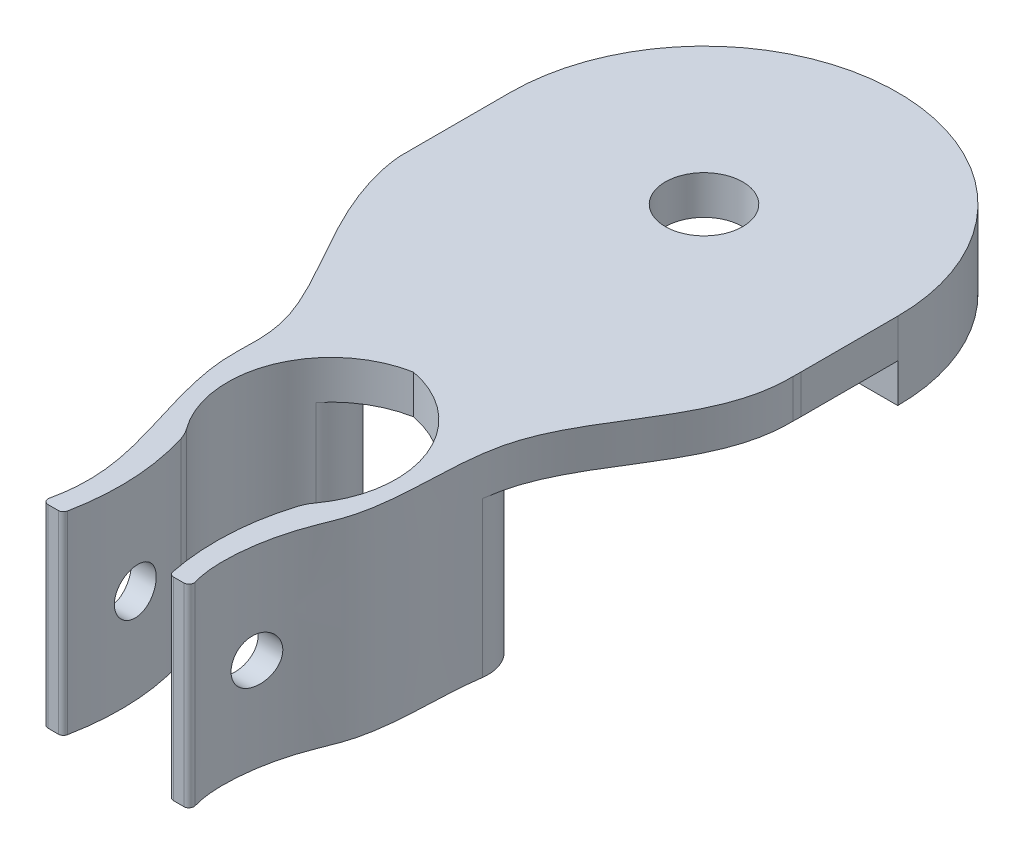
ISO-10303-21;
HEADER;
FILE_DESCRIPTION(('STEP AP214'),'2;1');
FILE_NAME('part.step','',(''),(''),'','','');
FILE_SCHEMA(('AUTOMOTIVE_DESIGN { 1 0 10303 214 1 1 1 1 }'));
ENDSEC;
DATA;
#1=APPLICATION_CONTEXT('core data for automotive mechanical design processes');
#2=APPLICATION_PROTOCOL_DEFINITION('international standard','automotive_design',2000,#1);
#3=PRODUCT_CONTEXT('',#1,'mechanical');
#4=PRODUCT('Part','Part','',(#3));
#5=PRODUCT_RELATED_PRODUCT_CATEGORY('part','',(#4));
#6=PRODUCT_DEFINITION_FORMATION('','',#4);
#7=PRODUCT_DEFINITION_CONTEXT('part definition',#1,'design');
#8=PRODUCT_DEFINITION('design','',#6,#7);
#9=PRODUCT_DEFINITION_SHAPE('','',#8);
#10=(LENGTH_UNIT() NAMED_UNIT(*) SI_UNIT(.MILLI.,.METRE.));
#11=(NAMED_UNIT(*) PLANE_ANGLE_UNIT() SI_UNIT($,.RADIAN.));
#12=(NAMED_UNIT(*) SI_UNIT($,.STERADIAN.) SOLID_ANGLE_UNIT());
#13=UNCERTAINTY_MEASURE_WITH_UNIT(LENGTH_MEASURE(1.E-05),#10,'distance_accuracy_value','');
#14=(GEOMETRIC_REPRESENTATION_CONTEXT(3) GLOBAL_UNCERTAINTY_ASSIGNED_CONTEXT((#13)) GLOBAL_UNIT_ASSIGNED_CONTEXT((#10,
#11,#12)) REPRESENTATION_CONTEXT('',''));
#15=CARTESIAN_POINT('',(0.,0.,0.));
#16=DIRECTION('',(0.,0.,1.));
#17=DIRECTION('',(1.,0.,0.));
#18=AXIS2_PLACEMENT_3D('',#15,#16,#17);
#19=CARTESIAN_POINT('',(0.,10.16,0.));
#20=DIRECTION('',(0.,1.,0.));
#21=DIRECTION('',(0.,0.,1.));
#22=AXIS2_PLACEMENT_3D('',#19,#20,#21);
#23=PLANE('',#22);
#24=CARTESIAN_POINT('',(0.,10.16,-6.35));
#25=DIRECTION('',(0.,-1.,0.));
#26=DIRECTION('',(0.,0.,-1.));
#27=AXIS2_PLACEMENT_3D('',#24,#25,#26);
#28=CIRCLE('',#27,2.54);
#29=CARTESIAN_POINT('',(0.,10.16,-8.89));
#30=VERTEX_POINT('',#29);
#31=EDGE_CURVE('E423',#30,#30,#28,.T.);
#32=ORIENTED_EDGE('',*,*,#31,.F.);
#33=EDGE_LOOP('',(#32));
#34=FACE_BOUND('',#33,.T.);
#35=DIRECTION('',(-1.,0.,0.));
#36=VECTOR('',#35,1.);
#37=CARTESIAN_POINT('',(0.,10.16,-6.35));
#38=LINE('',#37,#36);
#39=CARTESIAN_POINT('',(12.7,10.16,-6.35));
#40=VERTEX_POINT('',#39);
#41=CARTESIAN_POINT('',(8.89,10.16,-6.35));
#42=VERTEX_POINT('',#41);
#43=EDGE_CURVE('E255',#40,#42,#38,.T.);
#44=ORIENTED_EDGE('',*,*,#43,.F.);
#45=DIRECTION('',(0.,0.,1.));
#46=VECTOR('',#45,1.);
#47=CARTESIAN_POINT('',(12.7,10.16,0.));
#48=LINE('',#47,#46);
#49=CARTESIAN_POINT('',(12.7,10.16,0.));
#50=VERTEX_POINT('',#49);
#51=EDGE_CURVE('E294',#40,#50,#48,.T.);
#52=ORIENTED_EDGE('',*,*,#51,.T.);
#53=CARTESIAN_POINT('',(0.,10.16,0.));
#54=DIRECTION('',(0.,1.,0.));
#55=DIRECTION('',(0.,0.,1.));
#56=AXIS2_PLACEMENT_3D('',#53,#54,#55);
#57=CIRCLE('',#56,12.7);
#58=CARTESIAN_POINT('',(12.6900757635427,10.16,0.501973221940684));
#59=VERTEX_POINT('',#58);
#60=EDGE_CURVE('E345',#59,#50,#57,.T.);
#61=ORIENTED_EDGE('',*,*,#60,.F.);
#62=CARTESIAN_POINT('',(4.77346849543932,10.16,31.7962230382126));
#63=CARTESIAN_POINT('',(4.26261652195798,10.16,30.1479997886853));
#64=CARTESIAN_POINT('',(4.52523901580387,10.16,26.6602313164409));
#65=CARTESIAN_POINT('',(7.08560364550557,10.16,20.9954102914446));
#66=CARTESIAN_POINT('',(5.48854782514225,10.16,11.2875043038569));
#67=CARTESIAN_POINT('',(12.8342449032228,10.16,5.63803468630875));
#68=CARTESIAN_POINT('',(12.6900757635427,10.16,0.501973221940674));
#69=B_SPLINE_CURVE_WITH_KNOTS('',3,(#62,#63,#64,#65,#66,#67,#68),.UNSPECIFIED.,.F.,.F.,(4,1,1,1,
4),(0.,0.239032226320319,0.296991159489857,0.579589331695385,1.),.UNSPECIFIED.);
#70=CARTESIAN_POINT('',(6.90221502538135,10.16,15.0828782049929));
#71=VERTEX_POINT('',#70);
#72=EDGE_CURVE('E639',#71,#59,#69,.T.);
#73=ORIENTED_EDGE('',*,*,#72,.F.);
#74=CARTESIAN_POINT('',(4.38720927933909,10.16,14.7274262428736));
#75=DIRECTION('',(0.,1.,0.));
#76=DIRECTION('',(0.,0.,1.));
#77=AXIS2_PLACEMENT_3D('',#74,#75,#76);
#78=CIRCLE('',#77,2.54);
#79=CARTESIAN_POINT('',(3.66205072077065,10.16,12.293140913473));
#80=VERTEX_POINT('',#79);
#81=EDGE_CURVE('E596',#71,#80,#78,.T.);
#82=ORIENTED_EDGE('',*,*,#81,.T.);
#83=CARTESIAN_POINT('',(5.93221528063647,10.16,13.4324182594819));
#84=DIRECTION('',(0.,1.,0.));
#85=DIRECTION('',(0.,0.,1.));
#86=AXIS2_PLACEMENT_3D('',#83,#84,#85);
#87=CIRCLE('',#86,2.54);
#88=CARTESIAN_POINT('',(3.97241342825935,10.16,15.0482080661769));
#89=VERTEX_POINT('',#88);
#90=EDGE_CURVE('E11',#80,#89,#87,.T.);
#91=ORIENTED_EDGE('',*,*,#90,.T.);
#92=CARTESIAN_POINT('',(-1.25597785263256,10.16,19.3588384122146));
#93=DIRECTION('',(0.,1.,0.));
#94=DIRECTION('',(0.,0.,1.));
#95=AXIS2_PLACEMENT_3D('',#92,#93,#94);
#96=CIRCLE('',#95,6.77625334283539);
#97=CARTESIAN_POINT('',(0.,10.16,12.7));
#98=VERTEX_POINT('',#97);
#99=EDGE_CURVE('E638',#98,#89,#96,.F.);
#100=ORIENTED_EDGE('',*,*,#99,.F.);
#101=CARTESIAN_POINT('',(1.25597785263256,10.16,19.3588384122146));
#102=DIRECTION('',(0.,1.,0.));
#103=DIRECTION('',(0.,0.,1.));
#104=AXIS2_PLACEMENT_3D('',#101,#102,#103);
#105=CIRCLE('',#104,6.77625334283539);
#106=CARTESIAN_POINT('',(-3.99843270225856,10.16,15.0799624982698));
#107=VERTEX_POINT('',#106);
#108=EDGE_CURVE('E499',#107,#98,#105,.F.);
#109=ORIENTED_EDGE('',*,*,#108,.F.);
#110=CARTESIAN_POINT('',(-5.96798757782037,10.16,13.4760754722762));
#111=DIRECTION('',(0.,1.,0.));
#112=DIRECTION('',(0.,0.,1.));
#113=AXIS2_PLACEMENT_3D('',#110,#111,#112);
#114=CIRCLE('',#113,2.54);
#115=CARTESIAN_POINT('',(-3.73136641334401,10.16,12.2722790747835));
#116=VERTEX_POINT('',#115);
#117=EDGE_CURVE('E48',#107,#116,#114,.T.);
#118=ORIENTED_EDGE('',*,*,#117,.T.);
#119=CARTESIAN_POINT('',(-4.47025085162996,10.16,14.7024333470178));
#120=DIRECTION('',(0.,1.,0.));
#121=DIRECTION('',(0.,0.,1.));
#122=AXIS2_PLACEMENT_3D('',#119,#120,#121);
#123=CIRCLE('',#122,2.54);
#124=CARTESIAN_POINT('',(-6.99147324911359,10.16,15.0107150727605));
#125=VERTEX_POINT('',#124);
#126=EDGE_CURVE('E607',#116,#125,#123,.T.);
#127=ORIENTED_EDGE('',*,*,#126,.T.);
#128=CARTESIAN_POINT('',(-12.6900757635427,10.16,0.50197322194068));
#129=CARTESIAN_POINT('',(-12.7085946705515,10.16,0.534595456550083));
#130=CARTESIAN_POINT('',(-12.9445111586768,10.16,3.81873144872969));
#131=CARTESIAN_POINT('',(-6.44251711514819,10.16,13.8864500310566));
#132=CARTESIAN_POINT('',(-7.36026092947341,10.16,18.4591788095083));
#133=CARTESIAN_POINT('',(-5.27387900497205,10.16,24.7590934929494));
#134=CARTESIAN_POINT('',(-4.15604476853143,10.16,29.0328933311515));
#135=CARTESIAN_POINT('',(-4.77346849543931,10.16,31.7962230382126));
#136=B_SPLINE_CURVE_WITH_KNOTS('',3,(#128,#129,#130,#131,#132,#133,#134,#135),.UNSPECIFIED.,.F.,
.F.,(4,1,1,1,1,4),(0.,0.279659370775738,0.433863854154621,0.566787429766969,0.759908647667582,
0.988953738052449),.UNSPECIFIED.);
#137=CARTESIAN_POINT('',(-12.6900757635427,10.16,0.501973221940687));
#138=VERTEX_POINT('',#137);
#139=EDGE_CURVE('E637',#138,#125,#136,.T.);
#140=ORIENTED_EDGE('',*,*,#139,.F.);
#141=CARTESIAN_POINT('',(-12.7,10.16,0.));
#142=VERTEX_POINT('',#141);
#143=EDGE_CURVE('E344',#142,#138,#57,.T.);
#144=ORIENTED_EDGE('',*,*,#143,.F.);
#145=DIRECTION('',(0.,0.,-1.));
#146=VECTOR('',#145,1.);
#147=CARTESIAN_POINT('',(-12.7,10.16,0.));
#148=LINE('',#147,#146);
#149=CARTESIAN_POINT('',(-12.7,10.16,-6.35));
#150=VERTEX_POINT('',#149);
#151=EDGE_CURVE('E286',#142,#150,#148,.T.);
#152=ORIENTED_EDGE('',*,*,#151,.T.);
#153=DIRECTION('',(1.,0.,0.));
#154=VECTOR('',#153,1.);
#155=CARTESIAN_POINT('',(0.,10.16,-6.35));
#156=LINE('',#155,#154);
#157=CARTESIAN_POINT('',(-8.89,10.16,-6.35));
#158=VERTEX_POINT('',#157);
#159=EDGE_CURVE('E258',#150,#158,#156,.T.);
#160=ORIENTED_EDGE('',*,*,#159,.T.);
#161=DIRECTION('',(0.,0.,-1.));
#162=VECTOR('',#161,1.);
#163=CARTESIAN_POINT('',(-8.89,10.16,0.));
#164=LINE('',#163,#162);
#165=CARTESIAN_POINT('',(-8.89,10.16,-15.4196141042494));
#166=VERTEX_POINT('',#165);
#167=EDGE_CURVE('E256',#158,#166,#164,.T.);
#168=ORIENTED_EDGE('',*,*,#167,.T.);
#169=CARTESIAN_POINT('',(0.,10.16,-6.35));
#170=DIRECTION('',(0.,-1.,0.));
#171=DIRECTION('',(0.,0.,-1.));
#172=AXIS2_PLACEMENT_3D('',#169,#170,#171);
#173=CIRCLE('',#172,12.7);
#174=CARTESIAN_POINT('',(8.89,10.16,-15.4196141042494));
#175=VERTEX_POINT('',#174);
#176=EDGE_CURVE('E60',#166,#175,#173,.T.);
#177=ORIENTED_EDGE('',*,*,#176,.T.);
#178=DIRECTION('',(0.,0.,-1.));
#179=VECTOR('',#178,1.);
#180=CARTESIAN_POINT('',(8.89,10.16,0.));
#181=LINE('',#180,#179);
#182=EDGE_CURVE('E55',#42,#175,#181,.T.);
#183=ORIENTED_EDGE('',*,*,#182,.F.);
#184=EDGE_LOOP('',(#44,#52,#61,#73,#82,#91,#100,#109,#118,#127,#140,#144,#152,#160,#168,#177,#183));
#185=FACE_BOUND('',#184,.T.);
#186=ADVANCED_FACE('F35',(#34,#185),#23,.F.);
#187=CARTESIAN_POINT('',(0.,12.7,0.));
#188=DIRECTION('',(0.,-1.,0.));
#189=DIRECTION('',(0.,0.,-1.));
#190=AXIS2_PLACEMENT_3D('',#187,#188,#189);
#191=CYLINDRICAL_SURFACE('',#190,12.7);
#192=DIRECTION('',(0.,-1.,0.));
#193=VECTOR('',#192,1.);
#194=CARTESIAN_POINT('',(12.7,12.7,0.));
#195=LINE('',#194,#193);
#196=CARTESIAN_POINT('',(12.7,12.7,0.));
#197=VERTEX_POINT('',#196);
#198=EDGE_CURVE('E304',#197,#50,#195,.T.);
#199=ORIENTED_EDGE('',*,*,#198,.F.);
#200=CARTESIAN_POINT('',(0.,12.7,0.));
#201=DIRECTION('',(0.,1.,0.));
#202=DIRECTION('',(0.,0.,-1.));
#203=AXIS2_PLACEMENT_3D('',#200,#201,#202);
#204=CIRCLE('',#203,12.7);
#205=CARTESIAN_POINT('',(12.6900757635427,12.7,0.501973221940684));
#206=VERTEX_POINT('',#205);
#207=EDGE_CURVE('E484',#206,#197,#204,.T.);
#208=ORIENTED_EDGE('',*,*,#207,.F.);
#209=DIRECTION('',(0.,-1.,0.));
#210=VECTOR('',#209,1.);
#211=CARTESIAN_POINT('',(12.6900757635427,12.7,0.501973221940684));
#212=LINE('',#211,#210);
#213=EDGE_CURVE('E546',#206,#59,#212,.T.);
#214=ORIENTED_EDGE('',*,*,#213,.T.);
#215=ORIENTED_EDGE('',*,*,#60,.T.);
#216=EDGE_LOOP('',(#199,#208,#214,#215));
#217=FACE_BOUND('',#216,.T.);
#218=ADVANCED_FACE('F413',(#217),#191,.T.);
#219=CARTESIAN_POINT('',(-6.93411925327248,0.,15.7482204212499));
#220=DIRECTION('',(0.,-1.,0.));
#221=DIRECTION('',(0.,0.,-1.));
#222=AXIS2_PLACEMENT_3D('',#219,#220,#221);
#223=PLANE('',#222);
#224=CARTESIAN_POINT('',(-4.47025085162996,0.,14.7024333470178));
#225=DIRECTION('',(0.,-1.,0.));
#226=DIRECTION('',(0.,0.,-1.));
#227=AXIS2_PLACEMENT_3D('',#224,#225,#226);
#228=CIRCLE('',#227,2.54);
#229=CARTESIAN_POINT('',(-6.99147324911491,0.,15.0107150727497));
#230=VERTEX_POINT('',#229);
#231=CARTESIAN_POINT('',(-3.73136641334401,0.,12.2722790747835));
#232=VERTEX_POINT('',#231);
#233=EDGE_CURVE('E604',#230,#232,#228,.T.);
#234=ORIENTED_EDGE('',*,*,#233,.T.);
#235=CARTESIAN_POINT('',(-5.96798757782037,0.,13.4760754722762));
#236=DIRECTION('',(0.,-1.,0.));
#237=DIRECTION('',(0.,0.,-1.));
#238=AXIS2_PLACEMENT_3D('',#235,#236,#237);
#239=CIRCLE('',#238,2.54);
#240=CARTESIAN_POINT('',(-3.99843270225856,0.,15.0799624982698));
#241=VERTEX_POINT('',#240);
#242=EDGE_CURVE('E610',#232,#241,#239,.T.);
#243=ORIENTED_EDGE('',*,*,#242,.T.);
#244=CARTESIAN_POINT('',(1.25597785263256,0.,19.3588384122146));
#245=DIRECTION('',(0.,-1.,0.));
#246=DIRECTION('',(0.,0.,1.));
#247=AXIS2_PLACEMENT_3D('',#244,#245,#246);
#248=CIRCLE('',#247,6.77625334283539);
#249=CARTESIAN_POINT('',(-4.21241176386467,0.,23.3606285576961));
#250=VERTEX_POINT('',#249);
#251=EDGE_CURVE('E517',#250,#241,#248,.T.);
#252=ORIENTED_EDGE('',*,*,#251,.F.);
#253=CARTESIAN_POINT('',(-6.26217420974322,0.,24.8606531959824));
#254=DIRECTION('',(0.,1.,0.));
#255=DIRECTION('',(0.,0.,-1.));
#256=AXIS2_PLACEMENT_3D('',#253,#254,#255);
#257=CIRCLE('',#256,2.54);
#258=CARTESIAN_POINT('',(-3.83488723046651,0.,24.1124032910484));
#259=VERTEX_POINT('',#258);
#260=EDGE_CURVE('E512',#259,#250,#257,.T.);
#261=ORIENTED_EDGE('',*,*,#260,.F.);
#262=CARTESIAN_POINT('',(-3.45189480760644,0.,31.932369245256));
#263=CARTESIAN_POINT('',(-3.03837590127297,0.,29.8419376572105));
#264=CARTESIAN_POINT('',(-3.0285914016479,0.,27.2020407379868));
#265=CARTESIAN_POINT('',(-3.6668448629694,0.,24.6575247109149));
#266=CARTESIAN_POINT('',(-3.83488723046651,0.,24.1124032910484));
#267=B_SPLINE_CURVE_WITH_KNOTS('',3,(#262,#263,#264,#265,#266),.UNSPECIFIED.,.F.,.F.,(4,1,4),
(0.0550755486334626,0.772138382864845,0.969570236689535),.UNSPECIFIED.);
#268=CARTESIAN_POINT('',(-3.45189480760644,0.,31.932369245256));
#269=VERTEX_POINT('',#268);
#270=EDGE_CURVE('E508',#269,#259,#267,.T.);
#271=ORIENTED_EDGE('',*,*,#270,.F.);
#272=CARTESIAN_POINT('',(-3.77597646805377,0.,31.8682610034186));
#273=DIRECTION('',(0.,1.,0.));
#274=DIRECTION('',(0.,0.,-1.));
#275=AXIS2_PLACEMENT_3D('',#272,#273,#274);
#276=CIRCLE('',#275,0.330361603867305);
#277=CARTESIAN_POINT('',(-3.77597646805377,0.,32.1986226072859));
#278=VERTEX_POINT('',#277);
#279=EDGE_CURVE('E506',#278,#269,#276,.T.);
#280=ORIENTED_EDGE('',*,*,#279,.F.);
#281=DIRECTION('',(1.,0.,0.));
#282=VECTOR('',#281,1.);
#283=CARTESIAN_POINT('',(-4.45105676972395,0.,32.1986226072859));
#284=LINE('',#283,#282);
#285=CARTESIAN_POINT('',(-4.45105676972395,0.,32.1986226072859));
#286=VERTEX_POINT('',#285);
#287=EDGE_CURVE('E504',#286,#278,#284,.T.);
#288=ORIENTED_EDGE('',*,*,#287,.F.);
#289=CARTESIAN_POINT('',(-4.45105676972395,0.,31.8682610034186));
#290=DIRECTION('',(0.,1.,0.));
#291=DIRECTION('',(0.,0.,1.));
#292=AXIS2_PLACEMENT_3D('',#289,#290,#291);
#293=CIRCLE('',#292,0.330361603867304);
#294=CARTESIAN_POINT('',(-4.77346849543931,0.,31.7962230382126));
#295=VERTEX_POINT('',#294);
#296=EDGE_CURVE('E498',#295,#286,#293,.T.);
#297=ORIENTED_EDGE('',*,*,#296,.F.);
#298=CARTESIAN_POINT('',(-12.6900757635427,0.,0.50197322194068));
#299=CARTESIAN_POINT('',(-12.7085946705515,0.,0.534595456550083));
#300=CARTESIAN_POINT('',(-12.9445111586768,0.,3.81873144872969));
#301=CARTESIAN_POINT('',(-6.44251711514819,0.,13.8864500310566));
#302=CARTESIAN_POINT('',(-7.36026092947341,0.,18.4591788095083));
#303=CARTESIAN_POINT('',(-5.27387900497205,0.,24.7590934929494));
#304=CARTESIAN_POINT('',(-4.15604476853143,0.,29.0328933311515));
#305=CARTESIAN_POINT('',(-4.77346849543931,0.,31.7962230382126));
#306=B_SPLINE_CURVE_WITH_KNOTS('',3,(#298,#299,#300,#301,#302,#303,#304,#305),.UNSPECIFIED.,.F.,
.F.,(4,1,1,1,1,4),(0.,0.279659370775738,0.433863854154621,0.566787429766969,0.759908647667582,
0.988953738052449),.UNSPECIFIED.);
#307=EDGE_CURVE('E494',#230,#295,#306,.T.);
#308=ORIENTED_EDGE('',*,*,#307,.F.);
#309=EDGE_LOOP('',(#234,#243,#252,#261,#271,#280,#288,#297,#308));
#310=FACE_BOUND('',#309,.T.);
#311=ADVANCED_FACE('F409',(#310),#223,.T.);
#312=CARTESIAN_POINT('',(-12.6900757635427,12.7,0.50197322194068));
#313=CARTESIAN_POINT('',(-12.7085946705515,12.7,0.534595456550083));
#314=CARTESIAN_POINT('',(-12.9445111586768,12.7,3.81873144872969));
#315=CARTESIAN_POINT('',(-6.44251711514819,12.7,13.8864500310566));
#316=CARTESIAN_POINT('',(-7.36026092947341,12.7,18.4591788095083));
#317=CARTESIAN_POINT('',(-5.27387900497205,12.7,24.7590934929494));
#318=CARTESIAN_POINT('',(-4.15604476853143,12.7,29.0328933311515));
#319=CARTESIAN_POINT('',(-4.77346849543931,12.7,31.7962230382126));
#320=B_SPLINE_CURVE_WITH_KNOTS('',3,(#312,#313,#314,#315,#316,#317,#318,#319),.UNSPECIFIED.,.F.,
.F.,(4,1,1,1,1,4),(0.,0.279659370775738,0.433863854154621,0.566787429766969,0.759908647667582,
0.988953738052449),.UNSPECIFIED.);
#321=DIRECTION('',(0.,-1.,0.));
#322=VECTOR('',#321,1.);
#323=SURFACE_OF_LINEAR_EXTRUSION('',#320,#322);
#324=CARTESIAN_POINT('',(-4.95633280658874,6.16582696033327,26.2198274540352));
#325=CARTESIAN_POINT('',(-4.95633093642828,6.24700173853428,26.2198332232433));
#326=CARTESIAN_POINT('',(-4.95468988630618,6.32825554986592,26.2265713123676));
#327=CARTESIAN_POINT('',(-4.94984501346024,6.44829752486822,26.2465882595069));
#328=CARTESIAN_POINT('',(-4.94783030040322,6.48803576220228,26.2549227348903));
#329=CARTESIAN_POINT('',(-4.94303519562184,6.56668331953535,26.2748321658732));
#330=CARTESIAN_POINT('',(-4.94025417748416,6.60559193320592,26.2864097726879));
#331=CARTESIAN_POINT('',(-4.93082928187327,6.72045100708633,26.3258242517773));
#332=CARTESIAN_POINT('',(-4.92309473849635,6.79474723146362,26.3583785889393));
#333=CARTESIAN_POINT('',(-4.90513999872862,6.93677734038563,26.4350646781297));
#334=CARTESIAN_POINT('',(-4.89491932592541,7.00450996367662,26.4791986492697));
#335=CARTESIAN_POINT('',(-4.8780643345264,7.10031269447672,26.5534114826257));
#336=CARTESIAN_POINT('',(-4.87214051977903,7.13149723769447,26.5797179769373));
#337=CARTESIAN_POINT('',(-4.85988117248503,7.19150813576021,26.6347494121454));
#338=CARTESIAN_POINT('',(-4.85354604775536,7.22033676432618,26.6634719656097));
#339=CARTESIAN_POINT('',(-4.83403048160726,7.3030778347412,26.7530398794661));
#340=CARTESIAN_POINT('',(-4.82033748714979,7.35325866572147,26.8172957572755));
#341=CARTESIAN_POINT('',(-4.79194668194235,7.44340495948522,26.954756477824));
#342=CARTESIAN_POINT('',(-4.77723230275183,7.48308343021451,27.0281449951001));
#343=CARTESIAN_POINT('',(-4.7478441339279,7.54952543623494,27.1805759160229));
#344=CARTESIAN_POINT('',(-4.73317034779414,7.57628789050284,27.2596187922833));
#345=CARTESIAN_POINT('',(-4.70439156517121,7.61634436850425,27.4221089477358));
#346=CARTESIAN_POINT('',(-4.69029466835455,7.62948593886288,27.5055953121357));
#347=CARTESIAN_POINT('',(-4.66344952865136,7.64131172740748,27.6738028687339));
#348=CARTESIAN_POINT('',(-4.6507012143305,7.6399967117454,27.7585239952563));
#349=CARTESIAN_POINT('',(-4.62710919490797,7.62290283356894,27.9259812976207));
#350=CARTESIAN_POINT('',(-4.61624936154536,7.60725441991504,28.0087284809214));
#351=CARTESIAN_POINT('',(-4.59654475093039,7.56201088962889,28.1705694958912));
#352=CARTESIAN_POINT('',(-4.5876997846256,7.53241708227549,28.249663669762));
#353=CARTESIAN_POINT('',(-4.57219484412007,7.46064779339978,28.4005773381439));
#354=CARTESIAN_POINT('',(-4.56550202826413,7.41868223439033,28.4724933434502));
#355=CARTESIAN_POINT('',(-4.55397270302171,7.32316274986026,28.6083335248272));
#356=CARTESIAN_POINT('',(-4.54913611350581,7.26960932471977,28.6722580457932));
#357=CARTESIAN_POINT('',(-4.54107983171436,7.15291119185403,28.7897424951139));
#358=CARTESIAN_POINT('',(-4.53784746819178,7.0898469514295,28.8433815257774));
#359=CARTESIAN_POINT('',(-4.53260550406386,6.9556019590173,28.9393752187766));
#360=CARTESIAN_POINT('',(-4.53059590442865,6.88442120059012,28.9817298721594));
#361=CARTESIAN_POINT('',(-4.52746056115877,6.73592427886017,29.0539565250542));
#362=CARTESIAN_POINT('',(-4.52633526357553,6.65860504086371,29.0838222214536));
#363=CARTESIAN_POINT('',(-4.52469256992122,6.50005194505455,29.1301893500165));
#364=CARTESIAN_POINT('',(-4.52417517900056,6.41881805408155,29.1466906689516));
#365=CARTESIAN_POINT('',(-4.5235805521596,6.25457859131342,29.1658783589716));
#366=CARTESIAN_POINT('',(-4.52350414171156,6.17156998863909,29.1685388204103));
#367=CARTESIAN_POINT('',(-4.52376568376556,6.0062827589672,29.1598991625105));
#368=CARTESIAN_POINT('',(-4.52410363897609,5.92400413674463,29.1485989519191));
#369=CARTESIAN_POINT('',(-4.52531127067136,5.76247392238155,29.1123509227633));
#370=CARTESIAN_POINT('',(-4.52618119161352,5.68322373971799,29.0873968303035));
#371=CARTESIAN_POINT('',(-4.52869534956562,5.53004418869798,29.0245498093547));
#372=CARTESIAN_POINT('',(-4.53033958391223,5.45611480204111,28.9866569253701));
#373=CARTESIAN_POINT('',(-4.5347255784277,5.315737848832,28.8990565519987));
#374=CARTESIAN_POINT('',(-4.53746648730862,5.24928453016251,28.8493582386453));
#375=CARTESIAN_POINT('',(-4.54439265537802,5.12568716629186,28.7395737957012));
#376=CARTESIAN_POINT('',(-4.54857787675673,5.0685428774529,28.6794879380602));
#377=CARTESIAN_POINT('',(-4.55868346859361,4.96528612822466,28.5508211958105));
#378=CARTESIAN_POINT('',(-4.5646002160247,4.91915099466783,28.4822582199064));
#379=CARTESIAN_POINT('',(-4.57836141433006,4.83902980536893,28.3385472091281));
#380=CARTESIAN_POINT('',(-4.58620583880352,4.80504358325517,28.2633992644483));
#381=CARTESIAN_POINT('',(-4.60386021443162,4.75008054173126,28.1086349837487));
#382=CARTESIAN_POINT('',(-4.61367186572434,4.72911503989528,28.0290148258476));
#383=CARTESIAN_POINT('',(-4.63510249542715,4.70071797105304,27.8676361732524));
#384=CARTESIAN_POINT('',(-4.64672157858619,4.69328718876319,27.7858775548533));
#385=CARTESIAN_POINT('',(-4.67156280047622,4.69204470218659,27.6216286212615));
#386=CARTESIAN_POINT('',(-4.6848003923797,4.69837582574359,27.5391395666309));
#387=CARTESIAN_POINT('',(-4.71227529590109,4.72466608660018,27.3765440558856));
#388=CARTESIAN_POINT('',(-4.72651271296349,4.74462666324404,27.2964378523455));
#389=CARTESIAN_POINT('',(-4.75560874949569,4.79804313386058,27.1394370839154));
#390=CARTESIAN_POINT('',(-4.77047368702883,4.83171169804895,27.0626152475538));
#391=CARTESIAN_POINT('',(-4.79250147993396,4.89156529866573,26.9525368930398));
#392=CARTESIAN_POINT('',(-4.79980055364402,4.91308011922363,26.9166966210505));
#393=CARTESIAN_POINT('',(-4.81422874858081,4.95911590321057,26.8469095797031));
#394=CARTESIAN_POINT('',(-4.82135768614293,4.98363995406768,26.8129648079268));
#395=CARTESIAN_POINT('',(-4.84240612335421,5.06173030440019,26.714069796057));
#396=CARTESIAN_POINT('',(-4.85592141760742,5.11963802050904,26.6523839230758));
#397=CARTESIAN_POINT('',(-4.88109901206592,5.24537960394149,26.5396758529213));
#398=CARTESIAN_POINT('',(-4.89276166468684,5.31321157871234,26.4886516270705));
#399=CARTESIAN_POINT('',(-4.908284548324,5.42040035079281,26.4216479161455));
#400=CARTESIAN_POINT('',(-4.91310441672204,5.45677478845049,26.4010094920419));
#401=CARTESIAN_POINT('',(-4.92206046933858,5.53117479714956,26.3628837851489));
#402=CARTESIAN_POINT('',(-4.92619724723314,5.56919889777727,26.3453937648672));
#403=CARTESIAN_POINT('',(-4.93748410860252,5.68533852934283,26.2978861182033));
#404=CARTESIAN_POINT('',(-4.94352972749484,5.76565119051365,26.2727497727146));
#405=CARTESIAN_POINT('',(-4.95069263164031,5.89970092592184,26.2430743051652));
#406=CARTESIAN_POINT('',(-4.95280201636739,5.95251744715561,26.2343717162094));
#407=CARTESIAN_POINT('',(-4.95562270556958,6.05882018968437,26.2227464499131));
#408=CARTESIAN_POINT('',(-4.95633403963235,6.11230639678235,26.2198236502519));
#409=CARTESIAN_POINT('',(-4.95633280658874,6.16582696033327,26.2198274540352));
#410=B_SPLINE_CURVE_WITH_KNOTS('',3,(#324,#325,#326,#327,#328,#329,#330,#331,#332,#333,#334,
#335,#336,#337,#338,#339,#340,#341,#342,#343,#344,#345,#346,#347,#348,#349,#350,#351,#352,#353,
#354,#355,#356,#357,#358,#359,#360,#361,#362,#363,#364,#365,#366,#367,#368,#369,#370,#371,#372,
#373,#374,#375,#376,#377,#378,#379,#380,#381,#382,#383,#384,#385,#386,#387,#388,#389,#390,#391,
#392,#393,#394,#395,#396,#397,#398,#399,#400,#401,#402,#403,#404,#405,#406,#407,#408,#409),
.UNSPECIFIED.,.T.,.F.,(4,2,2,2,2,2,2,2,2,2,2,2,2,2,2,2,2,2,2,2,2,2,2,2,2,2,2,2,2,2,2,2,2,2,2,2,
2,2,2,2,2,2,4),(0.,0.24329340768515,0.365133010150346,0.487072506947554,0.730312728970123,
0.973599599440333,1.09715425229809,1.2205882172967,1.46740609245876,1.7203991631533,
1.97341340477,2.22922992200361,2.48503288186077,2.73853065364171,2.99200463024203,
3.24140354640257,3.49079169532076,3.73817734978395,3.98556320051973,4.23307375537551,
4.48058640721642,4.72856222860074,4.97653967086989,5.22463115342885,5.47272178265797,
5.72062020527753,5.96851213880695,6.21588904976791,6.46326257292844,6.71085081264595,
6.95845340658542,7.20863800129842,7.4588490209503,7.71309952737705,7.84027490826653,
7.96758187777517,8.22330883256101,8.47898708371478,8.60514352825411,8.73118974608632,
8.98282541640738,9.14323824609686,9.30364768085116),.UNSPECIFIED.);
#411=CARTESIAN_POINT('',(-4.95633280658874,6.16582696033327,26.2198274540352));
#412=VERTEX_POINT('',#411);
#413=EDGE_CURVE('E309',#412,#412,#410,.T.);
#414=ORIENTED_EDGE('',*,*,#413,.T.);
#415=EDGE_LOOP('',(#414));
#416=FACE_BOUND('',#415,.T.);
#417=ORIENTED_EDGE('',*,*,#139,.T.);
#418=DIRECTION('',(0.,-1.,0.));
#419=VECTOR('',#418,1.);
#420=CARTESIAN_POINT('',(-6.99147324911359,10.16,15.0107150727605));
#421=LINE('',#420,#419);
#422=EDGE_CURVE('E602',#125,#230,#421,.T.);
#423=ORIENTED_EDGE('',*,*,#422,.T.);
#424=ORIENTED_EDGE('',*,*,#307,.T.);
#425=DIRECTION('',(0.,-1.,0.));
#426=VECTOR('',#425,1.);
#427=CARTESIAN_POINT('',(-4.77346849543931,12.7,31.7962230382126));
#428=LINE('',#427,#426);
#429=CARTESIAN_POINT('',(-4.77346849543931,12.7,31.7962230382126));
#430=VERTEX_POINT('',#429);
#431=EDGE_CURVE('E585',#430,#295,#428,.T.);
#432=ORIENTED_EDGE('',*,*,#431,.F.);
#433=CARTESIAN_POINT('',(-12.6900757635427,12.7,0.501973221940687));
#434=VERTEX_POINT('',#433);
#435=EDGE_CURVE('E541',#434,#430,#320,.T.);
#436=ORIENTED_EDGE('',*,*,#435,.F.);
#437=DIRECTION('',(0.,-1.,0.));
#438=VECTOR('',#437,1.);
#439=CARTESIAN_POINT('',(-12.6900757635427,12.7,0.501973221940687));
#440=LINE('',#439,#438);
#441=EDGE_CURVE('E481',#434,#138,#440,.T.);
#442=ORIENTED_EDGE('',*,*,#441,.T.);
#443=EDGE_LOOP('',(#417,#423,#424,#432,#436,#442));
#444=FACE_BOUND('',#443,.T.);
#445=ADVANCED_FACE('F320',(#416,#444),#323,.F.);
#446=CARTESIAN_POINT('',(1.25597785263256,12.7,19.3588384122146));
#447=DIRECTION('',(0.,-1.,0.));
#448=DIRECTION('',(0.,0.,-1.));
#449=AXIS2_PLACEMENT_3D('',#446,#447,#448);
#450=CYLINDRICAL_SURFACE('',#449,6.77625334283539);
#451=ORIENTED_EDGE('',*,*,#251,.T.);
#452=DIRECTION('',(0.,-1.,0.));
#453=VECTOR('',#452,1.);
#454=CARTESIAN_POINT('',(-3.99843270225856,12.7,15.0799624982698));
#455=LINE('',#454,#453);
#456=EDGE_CURVE('E612',#241,#107,#455,.F.);
#457=ORIENTED_EDGE('',*,*,#456,.T.);
#458=ORIENTED_EDGE('',*,*,#108,.T.);
#459=DIRECTION('',(0.,-1.,0.));
#460=VECTOR('',#459,1.);
#461=CARTESIAN_POINT('',(0.,12.7,12.7));
#462=LINE('',#461,#460);
#463=CARTESIAN_POINT('',(0.,12.7,12.7));
#464=VERTEX_POINT('',#463);
#465=EDGE_CURVE('E567',#464,#98,#462,.T.);
#466=ORIENTED_EDGE('',*,*,#465,.F.);
#467=CARTESIAN_POINT('',(1.25597785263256,12.7,19.3588384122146));
#468=DIRECTION('',(0.,-1.,0.));
#469=DIRECTION('',(0.,0.,1.));
#470=AXIS2_PLACEMENT_3D('',#467,#468,#469);
#471=CIRCLE('',#470,6.77625334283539);
#472=CARTESIAN_POINT('',(-4.21241176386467,12.7,23.3606285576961));
#473=VERTEX_POINT('',#472);
#474=EDGE_CURVE('E371',#473,#464,#471,.T.);
#475=ORIENTED_EDGE('',*,*,#474,.F.);
#476=DIRECTION('',(0.,-1.,0.));
#477=VECTOR('',#476,1.);
#478=CARTESIAN_POINT('',(-4.21241176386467,12.7,23.3606285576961));
#479=LINE('',#478,#477);
#480=EDGE_CURVE('E570',#473,#250,#479,.T.);
#481=ORIENTED_EDGE('',*,*,#480,.T.);
#482=EDGE_LOOP('',(#451,#457,#458,#466,#475,#481));
#483=FACE_BOUND('',#482,.T.);
#484=ADVANCED_FACE('F402',(#483),#450,.F.);
#485=CARTESIAN_POINT('',(-1.25597785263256,12.7,19.3588384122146));
#486=DIRECTION('',(0.,-1.,0.));
#487=DIRECTION('',(0.,0.,-1.));
#488=AXIS2_PLACEMENT_3D('',#485,#486,#487);
#489=CYLINDRICAL_SURFACE('',#488,6.77625334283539);
#490=ORIENTED_EDGE('',*,*,#99,.T.);
#491=DIRECTION('',(0.,-1.,0.));
#492=VECTOR('',#491,1.);
#493=CARTESIAN_POINT('',(3.97241342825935,12.7,15.0482080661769));
#494=LINE('',#493,#492);
#495=CARTESIAN_POINT('',(3.97241342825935,0.,15.0482080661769));
#496=VERTEX_POINT('',#495);
#497=EDGE_CURVE('E615',#89,#496,#494,.T.);
#498=ORIENTED_EDGE('',*,*,#497,.T.);
#499=CARTESIAN_POINT('',(-1.25597785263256,0.,19.3588384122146));
#500=DIRECTION('',(0.,-1.,0.));
#501=DIRECTION('',(0.,0.,-1.));
#502=AXIS2_PLACEMENT_3D('',#499,#500,#501);
#503=CIRCLE('',#502,6.77625334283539);
#504=CARTESIAN_POINT('',(4.21241176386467,0.,23.3606285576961));
#505=VERTEX_POINT('',#504);
#506=EDGE_CURVE('E519',#496,#505,#503,.T.);
#507=ORIENTED_EDGE('',*,*,#506,.T.);
#508=DIRECTION('',(0.,-1.,0.));
#509=VECTOR('',#508,1.);
#510=CARTESIAN_POINT('',(4.21241176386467,12.7,23.3606285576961));
#511=LINE('',#510,#509);
#512=CARTESIAN_POINT('',(4.21241176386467,12.7,23.3606285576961));
#513=VERTEX_POINT('',#512);
#514=EDGE_CURVE('E564',#513,#505,#511,.T.);
#515=ORIENTED_EDGE('',*,*,#514,.F.);
#516=CARTESIAN_POINT('',(-1.25597785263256,12.7,19.3588384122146));
#517=DIRECTION('',(0.,-1.,0.));
#518=DIRECTION('',(0.,0.,-1.));
#519=AXIS2_PLACEMENT_3D('',#516,#517,#518);
#520=CIRCLE('',#519,6.77625334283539);
#521=EDGE_CURVE('E373',#464,#513,#520,.T.);
#522=ORIENTED_EDGE('',*,*,#521,.F.);
#523=ORIENTED_EDGE('',*,*,#465,.T.);
#524=EDGE_LOOP('',(#490,#498,#507,#515,#522,#523));
#525=FACE_BOUND('',#524,.T.);
#526=ADVANCED_FACE('F399',(#525),#489,.F.);
#527=CARTESIAN_POINT('',(4.77346849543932,12.7,31.7962230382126));
#528=CARTESIAN_POINT('',(4.26261652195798,12.7,30.1479997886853));
#529=CARTESIAN_POINT('',(4.52523901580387,12.7,26.6602313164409));
#530=CARTESIAN_POINT('',(7.08560364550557,12.7,20.9954102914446));
#531=CARTESIAN_POINT('',(5.48854782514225,12.7,11.2875043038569));
#532=CARTESIAN_POINT('',(12.8342449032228,12.7,5.63803468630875));
#533=CARTESIAN_POINT('',(12.6900757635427,12.7,0.501973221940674));
#534=B_SPLINE_CURVE_WITH_KNOTS('',3,(#527,#528,#529,#530,#531,#532,#533),.UNSPECIFIED.,.F.,.F.,
(4,1,1,1,4),(0.,0.239032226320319,0.296991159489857,0.579589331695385,1.),.UNSPECIFIED.);
#535=DIRECTION('',(0.,-1.,0.));
#536=VECTOR('',#535,1.);
#537=SURFACE_OF_LINEAR_EXTRUSION('',#534,#536);
#538=CARTESIAN_POINT('',(4.95845871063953,6.16582696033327,26.2198274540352));
#539=CARTESIAN_POINT('',(4.95845648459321,6.08479950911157,26.2198332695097));
#540=CARTESIAN_POINT('',(4.95671313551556,6.00369267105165,26.2265473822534));
#541=CARTESIAN_POINT('',(4.9515812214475,5.88387338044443,26.2464895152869));
#542=CARTESIAN_POINT('',(4.94944838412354,5.84420943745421,26.2547926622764));
#543=CARTESIAN_POINT('',(4.94438042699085,5.76571085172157,26.274625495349));
#544=CARTESIAN_POINT('',(4.94144465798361,5.72687690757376,26.2861577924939));
#545=CARTESIAN_POINT('',(4.93151565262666,5.61225019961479,26.3254107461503));
#546=CARTESIAN_POINT('',(4.92339080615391,5.53810931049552,26.3578250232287));
#547=CARTESIAN_POINT('',(4.90463187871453,5.39635927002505,26.4341701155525));
#548=CARTESIAN_POINT('',(4.89399726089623,5.32875152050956,26.478103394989));
#549=CARTESIAN_POINT('',(4.87654497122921,5.23301634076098,26.5520403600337));
#550=CARTESIAN_POINT('',(4.87041646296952,5.20180090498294,26.5782942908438));
#551=CARTESIAN_POINT('',(4.85776718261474,5.14172291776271,26.6332234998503));
#552=CARTESIAN_POINT('',(4.85124680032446,5.11285809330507,26.6618963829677));
#553=CARTESIAN_POINT('',(4.83121393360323,5.02999863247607,26.7513227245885));
#554=CARTESIAN_POINT('',(4.81722734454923,4.97972615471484,26.8154938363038));
#555=CARTESIAN_POINT('',(4.78834285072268,4.88930263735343,26.952922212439));
#556=CARTESIAN_POINT('',(4.77343060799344,4.84945588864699,27.0263755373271));
#557=CARTESIAN_POINT('',(4.74375116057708,4.78270859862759,27.1789889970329));
#558=CARTESIAN_POINT('',(4.72898396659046,4.75580900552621,27.2581495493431));
#559=CARTESIAN_POINT('',(4.70008899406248,4.71555381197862,27.4207926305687));
#560=CARTESIAN_POINT('',(4.68596872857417,4.70233092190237,27.5043093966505));
#561=CARTESIAN_POINT('',(4.65905230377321,4.69035619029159,27.6725875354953));
#562=CARTESIAN_POINT('',(4.64625607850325,4.6916036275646,27.7573488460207));
#563=CARTESIAN_POINT('',(4.62248192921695,4.7085721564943,27.9248639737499));
#564=CARTESIAN_POINT('',(4.61148826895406,4.7241591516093,28.0076291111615));
#565=CARTESIAN_POINT('',(4.59139006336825,4.76927992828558,28.1695070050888));
#566=CARTESIAN_POINT('',(4.58228535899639,4.79881253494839,28.2486200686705));
#567=CARTESIAN_POINT('',(4.56613190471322,4.87050792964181,28.3996769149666));
#568=CARTESIAN_POINT('',(4.55905473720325,4.91247744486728,28.4717094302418));
#569=CARTESIAN_POINT('',(4.5466782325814,5.00803989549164,28.6077719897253));
#570=CARTESIAN_POINT('',(4.54137881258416,5.06163228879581,28.6718024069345));
#571=CARTESIAN_POINT('',(4.53238140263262,5.17843369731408,28.7894713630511));
#572=CARTESIAN_POINT('',(4.52867064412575,5.24156030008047,28.8431907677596));
#573=CARTESIAN_POINT('',(4.52251523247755,5.37595870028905,28.9393228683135));
#574=CARTESIAN_POINT('',(4.52007057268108,5.44723045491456,28.9817356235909));
#575=CARTESIAN_POINT('',(4.51616716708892,5.59583696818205,29.0540018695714));
#576=CARTESIAN_POINT('',(4.51470768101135,5.67316712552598,29.0838647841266));
#577=CARTESIAN_POINT('',(4.51253618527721,5.83174552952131,29.1302233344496));
#578=CARTESIAN_POINT('',(4.51182418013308,5.9129937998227,29.1467188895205));
#579=CARTESIAN_POINT('',(4.51100322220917,6.07721570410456,29.1658849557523));
#580=CARTESIAN_POINT('',(4.51089505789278,6.16019145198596,29.1685373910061));
#581=CARTESIAN_POINT('',(4.51125973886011,6.32541215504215,29.1598928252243));
#582=CARTESIAN_POINT('',(4.51173258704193,6.40765710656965,29.1485957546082));
#583=CARTESIAN_POINT('',(4.51336065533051,6.56911727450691,29.1123665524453));
#584=CARTESIAN_POINT('',(4.51451616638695,6.64833118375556,29.0874286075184));
#585=CARTESIAN_POINT('',(4.51771634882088,6.80143947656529,29.024628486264));
#586=CARTESIAN_POINT('',(4.5197610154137,6.87533388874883,28.9867663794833));
#587=CARTESIAN_POINT('',(4.52500919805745,7.01565075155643,28.8992406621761));
#588=CARTESIAN_POINT('',(4.52821190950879,7.0820783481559,28.8495852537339));
#589=CARTESIAN_POINT('',(4.53605912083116,7.20563248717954,28.7399020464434));
#590=CARTESIAN_POINT('',(4.54070359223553,7.26275921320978,28.679874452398));
#591=CARTESIAN_POINT('',(4.55166591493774,7.36603739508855,28.5512843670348));
#592=CARTESIAN_POINT('',(4.55798161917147,7.41220278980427,28.4827328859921));
#593=CARTESIAN_POINT('',(4.57243330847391,7.49238589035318,28.3390377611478));
#594=CARTESIAN_POINT('',(4.58056928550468,7.52640364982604,28.2638941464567));
#595=CARTESIAN_POINT('',(4.59869529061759,7.58146295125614,28.1090326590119));
#596=CARTESIAN_POINT('',(4.60868909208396,7.60247770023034,28.0293057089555));
#597=CARTESIAN_POINT('',(4.63038584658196,7.63093564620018,27.8676945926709));
#598=CARTESIAN_POINT('',(4.6420888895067,7.63837812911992,27.7858103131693));
#599=CARTESIAN_POINT('',(4.66704632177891,7.63960045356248,27.6213301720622));
#600=CARTESIAN_POINT('',(4.68031518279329,7.63324157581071,27.5387354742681));
#601=CARTESIAN_POINT('',(4.70786966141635,7.60686158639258,27.375942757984));
#602=CARTESIAN_POINT('',(4.72215537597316,7.58683917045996,27.2957449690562));
#603=CARTESIAN_POINT('',(4.75141223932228,7.53330734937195,27.1386885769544));
#604=CARTESIAN_POINT('',(4.76639043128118,7.49960134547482,27.0618975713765));
#605=CARTESIAN_POINT('',(4.78868177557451,7.43970713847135,26.9518814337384));
#606=CARTESIAN_POINT('',(4.79608437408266,7.41818125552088,26.9160644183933));
#607=CARTESIAN_POINT('',(4.81075215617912,7.37212952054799,26.8463281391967));
#608=CARTESIAN_POINT('',(4.81801718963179,7.34760058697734,26.8124108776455));
#609=CARTESIAN_POINT('',(4.83953521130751,7.26946507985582,26.7135508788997));
#610=CARTESIAN_POINT('',(4.85343253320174,7.21151855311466,26.651883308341));
#611=CARTESIAN_POINT('',(4.87945954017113,7.08570544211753,26.5392212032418));
#612=CARTESIAN_POINT('',(4.89158956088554,7.01784074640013,26.4882246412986));
#613=CARTESIAN_POINT('',(4.90781529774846,6.91055265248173,26.4212353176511));
#614=CARTESIAN_POINT('',(4.91287075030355,6.87411281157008,26.400587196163));
#615=CARTESIAN_POINT('',(4.92228305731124,6.79957448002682,26.3624504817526));
#616=CARTESIAN_POINT('',(4.92664051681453,6.76147746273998,26.3449591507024));
#617=CARTESIAN_POINT('',(4.93854689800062,6.64510981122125,26.2974634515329));
#618=CARTESIAN_POINT('',(4.94495028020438,6.564629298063,26.2723541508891));
#619=CARTESIAN_POINT('',(4.95251426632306,6.43065506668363,26.2428465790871));
#620=CARTESIAN_POINT('',(4.95473647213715,6.37809510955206,26.2342294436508));
#621=CARTESIAN_POINT('',(4.95770940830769,6.27231051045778,26.2227180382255));
#622=CARTESIAN_POINT('',(4.95846017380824,6.21908588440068,26.219823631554));
#623=CARTESIAN_POINT('',(4.95845871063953,6.16582696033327,26.2198274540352));
#624=B_SPLINE_CURVE_WITH_KNOTS('',3,(#538,#539,#540,#541,#542,#543,#544,#545,#546,#547,#548,
#549,#550,#551,#552,#553,#554,#555,#556,#557,#558,#559,#560,#561,#562,#563,#564,#565,#566,#567,
#568,#569,#570,#571,#572,#573,#574,#575,#576,#577,#578,#579,#580,#581,#582,#583,#584,#585,#586,
#587,#588,#589,#590,#591,#592,#593,#594,#595,#596,#597,#598,#599,#600,#601,#602,#603,#604,#605,
#606,#607,#608,#609,#610,#611,#612,#613,#614,#615,#616,#617,#618,#619,#620,#621,#622,#623),
.UNSPECIFIED.,.T.,.F.,(4,2,2,2,2,2,2,2,2,2,2,2,2,2,2,2,2,2,2,2,2,2,2,2,2,2,2,2,2,2,2,2,2,2,2,2,
2,2,2,2,2,2,4),(0.,0.242851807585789,0.364472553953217,0.486191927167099,0.728959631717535,
0.971779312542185,1.0953935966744,1.2188868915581,1.46582477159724,1.71932135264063,
1.97283649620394,2.22878915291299,2.48472905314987,2.73829959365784,2.99184877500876,
3.24164773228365,3.49143504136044,3.73917522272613,3.98691410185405,4.23446661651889,
4.48202062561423,4.72989780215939,4.97777621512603,5.22576034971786,5.47374314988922,
5.72155398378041,5.96935992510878,6.21684903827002,6.46433705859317,6.71233334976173,
6.96034268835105,7.21085633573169,7.46139389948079,7.71566617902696,7.84285360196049,
7.97017264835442,8.22612433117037,8.48202734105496,8.60844947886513,8.73476142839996,
8.98691611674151,9.14654516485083,9.30617040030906),.UNSPECIFIED.);
#625=CARTESIAN_POINT('',(4.95845871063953,6.16582696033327,26.2198274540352));
#626=VERTEX_POINT('',#625);
#627=EDGE_CURVE('E39',#626,#626,#624,.T.);
#628=ORIENTED_EDGE('',*,*,#627,.T.);
#629=EDGE_LOOP('',(#628));
#630=FACE_BOUND('',#629,.T.);
#631=CARTESIAN_POINT('',(4.77346849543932,0.,31.7962230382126));
#632=CARTESIAN_POINT('',(4.26261652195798,0.,30.1479997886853));
#633=CARTESIAN_POINT('',(4.52523901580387,0.,26.6602313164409));
#634=CARTESIAN_POINT('',(7.08560364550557,0.,20.9954102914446));
#635=CARTESIAN_POINT('',(5.48854782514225,0.,11.2875043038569));
#636=CARTESIAN_POINT('',(12.8342449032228,0.,5.63803468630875));
#637=CARTESIAN_POINT('',(12.6900757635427,0.,0.501973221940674));
#638=B_SPLINE_CURVE_WITH_KNOTS('',3,(#631,#632,#633,#634,#635,#636,#637),.UNSPECIFIED.,.F.,.F.,
(4,1,1,1,4),(0.,0.239032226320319,0.296991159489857,0.579589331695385,1.),.UNSPECIFIED.);
#639=CARTESIAN_POINT('',(4.77346849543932,0.,31.7962230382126));
#640=VERTEX_POINT('',#639);
#641=CARTESIAN_POINT('',(6.90221502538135,0.,15.0828782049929));
#642=VERTEX_POINT('',#641);
#643=EDGE_CURVE('E536',#640,#642,#638,.T.);
#644=ORIENTED_EDGE('',*,*,#643,.T.);
#645=DIRECTION('',(0.,-1.,0.));
#646=VECTOR('',#645,1.);
#647=CARTESIAN_POINT('',(6.90221502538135,0.,15.0828782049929));
#648=LINE('',#647,#646);
#649=EDGE_CURVE('E593',#642,#71,#648,.F.);
#650=ORIENTED_EDGE('',*,*,#649,.T.);
#651=ORIENTED_EDGE('',*,*,#72,.T.);
#652=ORIENTED_EDGE('',*,*,#213,.F.);
#653=CARTESIAN_POINT('',(4.77346849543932,12.7,31.7962230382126));
#654=VERTEX_POINT('',#653);
#655=EDGE_CURVE('E485',#654,#206,#534,.T.);
#656=ORIENTED_EDGE('',*,*,#655,.F.);
#657=DIRECTION('',(0.,-1.,0.));
#658=VECTOR('',#657,1.);
#659=CARTESIAN_POINT('',(4.77346849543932,12.7,31.7962230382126));
#660=LINE('',#659,#658);
#661=EDGE_CURVE('E549',#654,#640,#660,.T.);
#662=ORIENTED_EDGE('',*,*,#661,.T.);
#663=EDGE_LOOP('',(#644,#650,#651,#652,#656,#662));
#664=FACE_BOUND('',#663,.T.);
#665=ADVANCED_FACE('F401',(#630,#664),#537,.F.);
#666=CARTESIAN_POINT('',(-6.93411925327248,12.7,15.7482204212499));
#667=DIRECTION('',(0.,-1.,0.));
#668=DIRECTION('',(0.,0.,-1.));
#669=AXIS2_PLACEMENT_3D('',#666,#667,#668);
#670=PLANE('',#669);
#671=CARTESIAN_POINT('',(0.,12.7,-6.35));
#672=DIRECTION('',(0.,-1.,0.));
#673=DIRECTION('',(0.,0.,-1.));
#674=AXIS2_PLACEMENT_3D('',#671,#672,#673);
#675=CIRCLE('',#674,2.54);
#676=CARTESIAN_POINT('',(0.,12.7,-8.89));
#677=VERTEX_POINT('',#676);
#678=EDGE_CURVE('E424',#677,#677,#675,.T.);
#679=ORIENTED_EDGE('',*,*,#678,.T.);
#680=EDGE_LOOP('',(#679));
#681=FACE_BOUND('',#680,.T.);
#682=ORIENTED_EDGE('',*,*,#207,.T.);
#683=DIRECTION('',(0.,0.,1.));
#684=VECTOR('',#683,1.);
#685=CARTESIAN_POINT('',(12.7,12.7,0.));
#686=LINE('',#685,#684);
#687=CARTESIAN_POINT('',(12.7,12.7,-6.35));
#688=VERTEX_POINT('',#687);
#689=EDGE_CURVE('E285',#688,#197,#686,.T.);
#690=ORIENTED_EDGE('',*,*,#689,.F.);
#691=CARTESIAN_POINT('',(0.,12.7,-6.35));
#692=DIRECTION('',(0.,-1.,0.));
#693=DIRECTION('',(0.,0.,-1.));
#694=AXIS2_PLACEMENT_3D('',#691,#692,#693);
#695=CIRCLE('',#694,12.7);
#696=CARTESIAN_POINT('',(-12.7,12.7,-6.35));
#697=VERTEX_POINT('',#696);
#698=EDGE_CURVE('E282',#697,#688,#695,.T.);
#699=ORIENTED_EDGE('',*,*,#698,.F.);
#700=DIRECTION('',(0.,0.,-1.));
#701=VECTOR('',#700,1.);
#702=CARTESIAN_POINT('',(-12.7,12.7,0.));
#703=LINE('',#702,#701);
#704=CARTESIAN_POINT('',(-12.7,12.7,0.));
#705=VERTEX_POINT('',#704);
#706=EDGE_CURVE('E289',#705,#697,#703,.T.);
#707=ORIENTED_EDGE('',*,*,#706,.F.);
#708=EDGE_CURVE('E479',#705,#434,#204,.T.);
#709=ORIENTED_EDGE('',*,*,#708,.T.);
#710=ORIENTED_EDGE('',*,*,#435,.T.);
#711=CARTESIAN_POINT('',(-4.45105676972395,12.7,31.8682610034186));
#712=DIRECTION('',(0.,1.,0.));
#713=DIRECTION('',(0.,0.,1.));
#714=AXIS2_PLACEMENT_3D('',#711,#712,#713);
#715=CIRCLE('',#714,0.330361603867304);
#716=CARTESIAN_POINT('',(-4.45105676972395,12.7,32.1986226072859));
#717=VERTEX_POINT('',#716);
#718=EDGE_CURVE('E655',#430,#717,#715,.T.);
#719=ORIENTED_EDGE('',*,*,#718,.T.);
#720=DIRECTION('',(1.,0.,0.));
#721=VECTOR('',#720,1.);
#722=CARTESIAN_POINT('',(-4.45105676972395,12.7,32.1986226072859));
#723=LINE('',#722,#721);
#724=CARTESIAN_POINT('',(-3.77597646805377,12.7,32.1986226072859));
#725=VERTEX_POINT('',#724);
#726=EDGE_CURVE('E659',#717,#725,#723,.T.);
#727=ORIENTED_EDGE('',*,*,#726,.T.);
#728=CARTESIAN_POINT('',(-3.77597646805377,12.7,31.8682610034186));
#729=DIRECTION('',(0.,1.,0.));
#730=DIRECTION('',(0.,0.,-1.));
#731=AXIS2_PLACEMENT_3D('',#728,#729,#730);
#732=CIRCLE('',#731,0.330361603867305);
#733=CARTESIAN_POINT('',(-3.45189480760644,12.7,31.932369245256));
#734=VERTEX_POINT('',#733);
#735=EDGE_CURVE('E365',#725,#734,#732,.T.);
#736=ORIENTED_EDGE('',*,*,#735,.T.);
#737=CARTESIAN_POINT('',(-3.45189480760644,12.7,31.932369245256));
#738=CARTESIAN_POINT('',(-3.03837590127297,12.7,29.8419376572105));
#739=CARTESIAN_POINT('',(-3.0285914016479,12.7,27.2020407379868));
#740=CARTESIAN_POINT('',(-3.6668448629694,12.7,24.6575247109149));
#741=CARTESIAN_POINT('',(-3.83488723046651,12.7,24.1124032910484));
#742=B_SPLINE_CURVE_WITH_KNOTS('',3,(#737,#738,#739,#740,#741),.UNSPECIFIED.,.F.,.F.,(4,1,4),
(0.0550755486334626,0.772138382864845,0.969570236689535),.UNSPECIFIED.);
#743=CARTESIAN_POINT('',(-3.83488723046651,12.7,24.1124032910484));
#744=VERTEX_POINT('',#743);
#745=EDGE_CURVE('E358',#734,#744,#742,.T.);
#746=ORIENTED_EDGE('',*,*,#745,.T.);
#747=CARTESIAN_POINT('',(-6.26217420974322,12.7,24.8606531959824));
#748=DIRECTION('',(0.,1.,0.));
#749=DIRECTION('',(0.,0.,-1.));
#750=AXIS2_PLACEMENT_3D('',#747,#748,#749);
#751=CIRCLE('',#750,2.54);
#752=EDGE_CURVE('E364',#744,#473,#751,.T.);
#753=ORIENTED_EDGE('',*,*,#752,.T.);
#754=ORIENTED_EDGE('',*,*,#474,.T.);
#755=ORIENTED_EDGE('',*,*,#521,.T.);
#756=CARTESIAN_POINT('',(6.26217420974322,12.7,24.8606531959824));
#757=DIRECTION('',(0.,1.,0.));
#758=DIRECTION('',(0.,0.,1.));
#759=AXIS2_PLACEMENT_3D('',#756,#757,#758);
#760=CIRCLE('',#759,2.54);
#761=CARTESIAN_POINT('',(3.83488723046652,12.7,24.1124032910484));
#762=VERTEX_POINT('',#761);
#763=EDGE_CURVE('E375',#513,#762,#760,.T.);
#764=ORIENTED_EDGE('',*,*,#763,.T.);
#765=CARTESIAN_POINT('',(3.83488723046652,12.7,24.1124032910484));
#766=CARTESIAN_POINT('',(3.66684486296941,12.7,24.6575247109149));
#767=CARTESIAN_POINT('',(3.02859140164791,12.7,27.2020407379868));
#768=CARTESIAN_POINT('',(3.03837590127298,12.7,29.8419376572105));
#769=CARTESIAN_POINT('',(3.45189480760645,12.7,31.932369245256));
#770=B_SPLINE_CURVE_WITH_KNOTS('',3,(#765,#766,#767,#768,#769),.UNSPECIFIED.,.F.,.F.,(4,1,4),
(0.0550755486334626,0.252507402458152,0.969570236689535),.UNSPECIFIED.);
#771=CARTESIAN_POINT('',(3.45189480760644,12.7,31.932369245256));
#772=VERTEX_POINT('',#771);
#773=EDGE_CURVE('E377',#762,#772,#770,.T.);
#774=ORIENTED_EDGE('',*,*,#773,.T.);
#775=CARTESIAN_POINT('',(3.77597646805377,12.7,31.8682610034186));
#776=DIRECTION('',(0.,1.,0.));
#777=DIRECTION('',(0.,0.,1.));
#778=AXIS2_PLACEMENT_3D('',#775,#776,#777);
#779=CIRCLE('',#778,0.330361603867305);
#780=CARTESIAN_POINT('',(3.77597646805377,12.7,32.1986226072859));
#781=VERTEX_POINT('',#780);
#782=EDGE_CURVE('E382',#772,#781,#779,.T.);
#783=ORIENTED_EDGE('',*,*,#782,.T.);
#784=DIRECTION('',(1.,0.,0.));
#785=VECTOR('',#784,1.);
#786=CARTESIAN_POINT('',(4.45105676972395,12.7,32.1986226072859));
#787=LINE('',#786,#785);
#788=CARTESIAN_POINT('',(4.45105676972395,12.7,32.1986226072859));
#789=VERTEX_POINT('',#788);
#790=EDGE_CURVE('E691',#781,#789,#787,.T.);
#791=ORIENTED_EDGE('',*,*,#790,.T.);
#792=CARTESIAN_POINT('',(4.45105676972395,12.7,31.8682610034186));
#793=DIRECTION('',(0.,1.,0.));
#794=DIRECTION('',(0.,0.,-1.));
#795=AXIS2_PLACEMENT_3D('',#792,#793,#794);
#796=CIRCLE('',#795,0.330361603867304);
#797=EDGE_CURVE('E487',#789,#654,#796,.T.);
#798=ORIENTED_EDGE('',*,*,#797,.T.);
#799=ORIENTED_EDGE('',*,*,#655,.T.);
#800=EDGE_LOOP('',(#682,#690,#699,#707,#709,#710,#719,#727,#736,#746,#753,#754,#755,#764,#774,
#783,#791,#798,#799));
#801=FACE_BOUND('',#800,.T.);
#802=ADVANCED_FACE('F434',(#681,#801),#670,.F.);
#803=ORIENTED_EDGE('',*,*,#506,.F.);
#804=CARTESIAN_POINT('',(5.93221528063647,0.,13.4324182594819));
#805=DIRECTION('',(0.,-1.,0.));
#806=DIRECTION('',(0.,0.,-1.));
#807=AXIS2_PLACEMENT_3D('',#804,#805,#806);
#808=CIRCLE('',#807,2.54);
#809=CARTESIAN_POINT('',(3.66205072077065,0.,12.293140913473));
#810=VERTEX_POINT('',#809);
#811=EDGE_CURVE('E617',#496,#810,#808,.T.);
#812=ORIENTED_EDGE('',*,*,#811,.T.);
#813=CARTESIAN_POINT('',(4.38720927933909,0.,14.7274262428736));
#814=DIRECTION('',(0.,-1.,0.));
#815=DIRECTION('',(0.,0.,-1.));
#816=AXIS2_PLACEMENT_3D('',#813,#814,#815);
#817=CIRCLE('',#816,2.54);
#818=EDGE_CURVE('E591',#810,#642,#817,.T.);
#819=ORIENTED_EDGE('',*,*,#818,.T.);
#820=ORIENTED_EDGE('',*,*,#643,.F.);
#821=CARTESIAN_POINT('',(4.45105676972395,0.,31.8682610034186));
#822=DIRECTION('',(0.,1.,0.));
#823=DIRECTION('',(0.,0.,-1.));
#824=AXIS2_PLACEMENT_3D('',#821,#822,#823);
#825=CIRCLE('',#824,0.330361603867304);
#826=CARTESIAN_POINT('',(4.45105676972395,0.,32.1986226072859));
#827=VERTEX_POINT('',#826);
#828=EDGE_CURVE('E534',#827,#640,#825,.T.);
#829=ORIENTED_EDGE('',*,*,#828,.F.);
#830=DIRECTION('',(1.,0.,0.));
#831=VECTOR('',#830,1.);
#832=CARTESIAN_POINT('',(4.45105676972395,0.,32.1986226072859));
#833=LINE('',#832,#831);
#834=CARTESIAN_POINT('',(3.77597646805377,0.,32.1986226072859));
#835=VERTEX_POINT('',#834);
#836=EDGE_CURVE('E532',#835,#827,#833,.T.);
#837=ORIENTED_EDGE('',*,*,#836,.F.);
#838=CARTESIAN_POINT('',(3.77597646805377,0.,31.8682610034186));
#839=DIRECTION('',(0.,1.,0.));
#840=DIRECTION('',(0.,0.,1.));
#841=AXIS2_PLACEMENT_3D('',#838,#839,#840);
#842=CIRCLE('',#841,0.330361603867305);
#843=CARTESIAN_POINT('',(3.45189480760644,0.,31.932369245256));
#844=VERTEX_POINT('',#843);
#845=EDGE_CURVE('E527',#844,#835,#842,.T.);
#846=ORIENTED_EDGE('',*,*,#845,.F.);
#847=CARTESIAN_POINT('',(3.83488723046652,0.,24.1124032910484));
#848=CARTESIAN_POINT('',(3.66684486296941,0.,24.6575247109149));
#849=CARTESIAN_POINT('',(3.02859140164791,0.,27.2020407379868));
#850=CARTESIAN_POINT('',(3.03837590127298,0.,29.8419376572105));
#851=CARTESIAN_POINT('',(3.45189480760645,0.,31.932369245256));
#852=B_SPLINE_CURVE_WITH_KNOTS('',3,(#847,#848,#849,#850,#851),.UNSPECIFIED.,.F.,.F.,(4,1,4),
(0.0550755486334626,0.252507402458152,0.969570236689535),.UNSPECIFIED.);
#853=CARTESIAN_POINT('',(3.83488723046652,0.,24.1124032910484));
#854=VERTEX_POINT('',#853);
#855=EDGE_CURVE('E523',#854,#844,#852,.T.);
#856=ORIENTED_EDGE('',*,*,#855,.F.);
#857=CARTESIAN_POINT('',(6.26217420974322,0.,24.8606531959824));
#858=DIRECTION('',(0.,1.,0.));
#859=DIRECTION('',(0.,0.,1.));
#860=AXIS2_PLACEMENT_3D('',#857,#858,#859);
#861=CIRCLE('',#860,2.54);
#862=EDGE_CURVE('E521',#505,#854,#861,.T.);
#863=ORIENTED_EDGE('',*,*,#862,.F.);
#864=EDGE_LOOP('',(#803,#812,#819,#820,#829,#837,#846,#856,#863));
#865=FACE_BOUND('',#864,.T.);
#866=ADVANCED_FACE('F713',(#865),#223,.T.);
#867=CARTESIAN_POINT('',(-4.45105676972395,12.7,31.8682610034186));
#868=DIRECTION('',(0.,-1.,0.));
#869=DIRECTION('',(0.,0.,-1.));
#870=AXIS2_PLACEMENT_3D('',#867,#868,#869);
#871=CYLINDRICAL_SURFACE('',#870,0.330361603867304);
#872=ORIENTED_EDGE('',*,*,#296,.T.);
#873=DIRECTION('',(0.,-1.,0.));
#874=VECTOR('',#873,1.);
#875=CARTESIAN_POINT('',(-4.45105676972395,12.7,32.1986226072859));
#876=LINE('',#875,#874);
#877=EDGE_CURVE('E582',#717,#286,#876,.T.);
#878=ORIENTED_EDGE('',*,*,#877,.F.);
#879=ORIENTED_EDGE('',*,*,#718,.F.);
#880=ORIENTED_EDGE('',*,*,#431,.T.);
#881=EDGE_LOOP('',(#872,#878,#879,#880));
#882=FACE_BOUND('',#881,.T.);
#883=ADVANCED_FACE('F729',(#882),#871,.T.);
#884=CARTESIAN_POINT('',(-4.45105676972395,12.7,32.1986226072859));
#885=DIRECTION('',(0.,0.,-1.));
#886=DIRECTION('',(-1.,0.,0.));
#887=AXIS2_PLACEMENT_3D('',#884,#885,#886);
#888=PLANE('',#887);
#889=ORIENTED_EDGE('',*,*,#287,.T.);
#890=DIRECTION('',(0.,-1.,0.));
#891=VECTOR('',#890,1.);
#892=CARTESIAN_POINT('',(-3.77597646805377,12.7,32.1986226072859));
#893=LINE('',#892,#891);
#894=EDGE_CURVE('E579',#725,#278,#893,.T.);
#895=ORIENTED_EDGE('',*,*,#894,.F.);
#896=ORIENTED_EDGE('',*,*,#726,.F.);
#897=ORIENTED_EDGE('',*,*,#877,.T.);
#898=EDGE_LOOP('',(#889,#895,#896,#897));
#899=FACE_BOUND('',#898,.T.);
#900=ADVANCED_FACE('F747',(#899),#888,.F.);
#901=CARTESIAN_POINT('',(-3.77597646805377,12.7,31.8682610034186));
#902=DIRECTION('',(0.,-1.,0.));
#903=DIRECTION('',(0.,0.,-1.));
#904=AXIS2_PLACEMENT_3D('',#901,#902,#903);
#905=CYLINDRICAL_SURFACE('',#904,0.330361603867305);
#906=ORIENTED_EDGE('',*,*,#279,.T.);
#907=DIRECTION('',(0.,-1.,0.));
#908=VECTOR('',#907,1.);
#909=CARTESIAN_POINT('',(-3.45189480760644,12.7,31.932369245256));
#910=LINE('',#909,#908);
#911=EDGE_CURVE('E576',#734,#269,#910,.T.);
#912=ORIENTED_EDGE('',*,*,#911,.F.);
#913=ORIENTED_EDGE('',*,*,#735,.F.);
#914=ORIENTED_EDGE('',*,*,#894,.T.);
#915=EDGE_LOOP('',(#906,#912,#913,#914));
#916=FACE_BOUND('',#915,.T.);
#917=ADVANCED_FACE('F354',(#916),#905,.T.);
#918=DIRECTION('',(0.,-1.,0.));
#919=VECTOR('',#918,1.);
#920=SURFACE_OF_LINEAR_EXTRUSION('',#742,#919);
#921=CARTESIAN_POINT('',(-3.33934247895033,6.16582696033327,26.2198274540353));
#922=CARTESIAN_POINT('',(-3.33934086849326,6.08373832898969,26.2198331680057));
#923=CARTESIAN_POINT('',(-3.33821005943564,6.00156900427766,26.226722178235));
#924=CARTESIAN_POINT('',(-3.33489129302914,5.88016079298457,26.2472026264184));
#925=CARTESIAN_POINT('',(-3.33351287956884,5.83996798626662,26.2557313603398));
#926=CARTESIAN_POINT('',(-3.33024358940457,5.76041519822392,26.2761133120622));
#927=CARTESIAN_POINT('',(-3.32835227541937,5.72105595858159,26.2879693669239));
#928=CARTESIAN_POINT('',(-3.32196873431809,5.60483588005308,26.3283600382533));
#929=CARTESIAN_POINT('',(-3.31676155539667,5.52964543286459,26.3617490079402));
#930=CARTESIAN_POINT('',(-3.30483871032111,5.3859491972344,26.4405007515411));
#931=CARTESIAN_POINT('',(-3.29812289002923,5.31744409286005,26.4858647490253));
#932=CARTESIAN_POINT('',(-3.287270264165,5.22087860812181,26.562056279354));
#933=CARTESIAN_POINT('',(-3.28350487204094,5.1896002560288,26.588945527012));
#934=CARTESIAN_POINT('',(-3.27579029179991,5.12944594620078,26.6452071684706));
#935=CARTESIAN_POINT('',(-3.27184128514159,5.10056769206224,26.6745771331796));
#936=CARTESIAN_POINT('',(-3.25981332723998,5.01777101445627,26.7661781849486));
#937=CARTESIAN_POINT('',(-3.25155115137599,4.96767081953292,26.8319161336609));
#938=CARTESIAN_POINT('',(-3.23502516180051,4.87874108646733,26.9714682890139));
#939=CARTESIAN_POINT('',(-3.22676208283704,4.8400235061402,27.0453534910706));
#940=CARTESIAN_POINT('',(-3.21081925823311,4.77556656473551,27.1986549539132));
#941=CARTESIAN_POINT('',(-3.203139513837,4.74982723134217,27.2780712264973));
#942=CARTESIAN_POINT('',(-3.18877972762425,4.71210242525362,27.4401846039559));
#943=CARTESIAN_POINT('',(-3.18209958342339,4.70011554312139,27.522881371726));
#944=CARTESIAN_POINT('',(-3.17002334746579,4.6902788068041,27.6892048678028));
#945=CARTESIAN_POINT('',(-3.16462720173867,4.69242835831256,27.7728315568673));
#946=CARTESIAN_POINT('',(-3.15528621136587,4.71078433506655,27.9380390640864));
#947=CARTESIAN_POINT('',(-3.15133186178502,4.72689624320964,28.0196298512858));
#948=CARTESIAN_POINT('',(-3.14480750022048,4.7726199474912,28.1789943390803));
#949=CARTESIAN_POINT('',(-3.14223745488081,4.80223141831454,28.2567681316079));
#950=CARTESIAN_POINT('',(-3.13833932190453,4.87395943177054,28.4059186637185));
#951=CARTESIAN_POINT('',(-3.13700571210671,4.91601925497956,28.4773225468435));
#952=CARTESIAN_POINT('',(-3.13530828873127,5.01150373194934,28.612090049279));
#953=CARTESIAN_POINT('',(-3.13494447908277,5.06492843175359,28.6754536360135));
#954=CARTESIAN_POINT('',(-3.13487197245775,5.18167132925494,28.7923846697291));
#955=CARTESIAN_POINT('',(-3.13516373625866,5.24499645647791,28.8459451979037));
#956=CARTESIAN_POINT('',(-3.13607098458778,5.3797220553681,28.9417017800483));
#957=CARTESIAN_POINT('',(-3.13668647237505,5.45112260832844,28.9838977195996));
#958=CARTESIAN_POINT('',(-3.1379383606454,5.6001306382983,29.055805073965));
#959=CARTESIAN_POINT('',(-3.13857480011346,5.67775012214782,29.085491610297));
#960=CARTESIAN_POINT('',(-3.13963032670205,5.83687180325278,29.1314168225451));
#961=CARTESIAN_POINT('',(-3.14004941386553,5.91837399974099,29.1476555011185));
#962=CARTESIAN_POINT('',(-3.14053278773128,6.08296906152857,29.1662258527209));
#963=CARTESIAN_POINT('',(-3.14059698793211,6.16606230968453,29.1685541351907));
#964=CARTESIAN_POINT('',(-3.14035017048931,6.33145979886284,29.1592282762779));
#965=CARTESIAN_POINT('',(-3.14003915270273,6.41376403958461,29.1475741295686));
#966=CARTESIAN_POINT('',(-3.13914188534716,6.57522581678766,29.1106197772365));
#967=CARTESIAN_POINT('',(-3.13855570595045,6.65438414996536,29.0853230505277));
#968=CARTESIAN_POINT('',(-3.13731499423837,6.80733247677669,29.0218035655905));
#969=CARTESIAN_POINT('',(-3.13666046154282,6.88112244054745,28.9835807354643));
#970=CARTESIAN_POINT('',(-3.13556998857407,7.02126691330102,28.8952764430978));
#971=CARTESIAN_POINT('',(-3.13513412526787,7.08761879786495,28.8451908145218));
#972=CARTESIAN_POINT('',(-3.13481150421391,7.21097254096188,28.7345892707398));
#973=CARTESIAN_POINT('',(-3.13492474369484,7.26797444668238,28.6740734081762));
#974=CARTESIAN_POINT('',(-3.1360282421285,7.37096806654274,28.5443821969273));
#975=CARTESIAN_POINT('',(-3.1370178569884,7.41696783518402,28.4752132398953));
#976=CARTESIAN_POINT('',(-3.14015240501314,7.49670273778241,28.3301594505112));
#977=CARTESIAN_POINT('',(-3.14229731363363,7.53043813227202,28.2542747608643));
#978=CARTESIAN_POINT('',(-3.14792398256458,7.5846368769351,28.0981341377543));
#979=CARTESIAN_POINT('',(-3.15140288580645,7.60512834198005,28.0178878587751));
#980=CARTESIAN_POINT('',(-3.15975948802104,7.63239895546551,27.8551710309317));
#981=CARTESIAN_POINT('',(-3.16463718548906,7.6391781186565,27.7727004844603));
#982=CARTESIAN_POINT('',(-3.17571244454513,7.6388706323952,27.6078350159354));
#983=CARTESIAN_POINT('',(-3.18191061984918,7.63177752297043,27.5254401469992));
#984=CARTESIAN_POINT('',(-3.19539584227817,7.60396631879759,27.3630861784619));
#985=CARTESIAN_POINT('',(-3.20268293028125,7.58324771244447,27.2831271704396));
#986=CARTESIAN_POINT('',(-3.21803565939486,7.52861295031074,27.1273645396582));
#987=CARTESIAN_POINT('',(-3.22610554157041,7.49462149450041,27.0515874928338));
#988=CARTESIAN_POINT('',(-3.23839852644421,7.43454320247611,26.9430989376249));
#989=CARTESIAN_POINT('',(-3.24252839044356,7.41299671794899,26.9077923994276));
#990=CARTESIAN_POINT('',(-3.2507915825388,7.3669929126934,26.8390781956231));
#991=CARTESIAN_POINT('',(-3.25492491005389,7.34253275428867,26.8056724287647));
#992=CARTESIAN_POINT('',(-3.26726433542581,7.26477932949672,26.7083811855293));
#993=CARTESIAN_POINT('',(-3.27537121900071,7.20729865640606,26.6477564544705));
#994=CARTESIAN_POINT('',(-3.29073148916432,7.08286080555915,26.5370422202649));
#995=CARTESIAN_POINT('',(-3.2979849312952,7.01590424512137,26.4869520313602));
#996=CARTESIAN_POINT('',(-3.30780939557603,6.90989490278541,26.4208569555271));
#997=CARTESIAN_POINT('',(-3.31090748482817,6.87364125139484,26.4003368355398));
#998=CARTESIAN_POINT('',(-3.31669493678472,6.79953934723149,26.3624416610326));
#999=CARTESIAN_POINT('',(-3.31938465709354,6.76169252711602,26.3450638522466));
#1000=CARTESIAN_POINT('',(-3.32675631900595,6.64615805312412,26.2978579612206));
#1001=CARTESIAN_POINT('',(-3.33075209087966,6.56635657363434,26.2728828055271));
#1002=CARTESIAN_POINT('',(-3.3355347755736,6.43270723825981,26.2432064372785));
#1003=CARTESIAN_POINT('',(-3.3369576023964,6.37973092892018,26.2344531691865));
#1004=CARTESIAN_POINT('',(-3.33886197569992,6.27312355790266,26.2227618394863));
#1005=CARTESIAN_POINT('',(-3.3393435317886,6.21949250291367,26.2198237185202));
#1006=CARTESIAN_POINT('',(-3.33934247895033,6.16582696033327,26.2198274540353));
#1007=B_SPLINE_CURVE_WITH_KNOTS('',3,(#921,#922,#923,#924,#925,#926,#927,#928,#929,#930,#931,
#932,#933,#934,#935,#936,#937,#938,#939,#940,#941,#942,#943,#944,#945,#946,#947,#948,#949,#950,
#951,#952,#953,#954,#955,#956,#957,#958,#959,#960,#961,#962,#963,#964,#965,#966,#967,#968,#969,
#970,#971,#972,#973,#974,#975,#976,#977,#978,#979,#980,#981,#982,#983,#984,#985,#986,#987,#988,
#989,#990,#991,#992,#993,#994,#995,#996,#997,#998,#999,#1000,#1001,#1002,#1003,#1004,#1005,
#1006),.UNSPECIFIED.,.T.,.F.,(4,2,2,2,2,2,2,2,2,2,2,2,2,2,2,2,2,2,2,2,2,2,2,2,2,2,2,2,2,2,2,2,2,
2,2,2,2,2,2,2,2,2,4),(0.,0.246035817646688,0.369248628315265,0.492566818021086,
0.738640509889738,0.984739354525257,1.10886933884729,1.23287915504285,1.48082348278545,
1.73113068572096,1.98143842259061,2.23172050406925,2.48199206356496,2.73058254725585,
2.97916704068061,3.22663588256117,3.47410572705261,3.72174956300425,3.9693958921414,
4.21753243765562,4.4656689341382,4.71386590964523,4.96206297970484,5.21019678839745,
5.45833197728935,5.70655444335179,5.95477565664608,6.20281459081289,6.45084825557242,
6.69835363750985,6.94585875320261,7.19347915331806,7.44110885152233,7.69016431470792,
7.81474172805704,7.93944147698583,8.18998013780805,8.44050248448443,8.56568748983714,
8.69076223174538,8.94049225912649,9.10134011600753,9.26218633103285),.UNSPECIFIED.);
#1008=CARTESIAN_POINT('',(-3.33934247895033,6.16582696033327,26.2198274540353));
#1009=VERTEX_POINT('',#1008);
#1010=EDGE_CURVE('E338',#1009,#1009,#1007,.T.);
#1011=ORIENTED_EDGE('',*,*,#1010,.T.);
#1012=EDGE_LOOP('',(#1011));
#1013=FACE_BOUND('',#1012,.T.);
#1014=ORIENTED_EDGE('',*,*,#270,.T.);
#1015=DIRECTION('',(0.,-1.,0.));
#1016=VECTOR('',#1015,1.);
#1017=CARTESIAN_POINT('',(-3.83488723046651,12.7,24.1124032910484));
#1018=LINE('',#1017,#1016);
#1019=EDGE_CURVE('E573',#744,#259,#1018,.T.);
#1020=ORIENTED_EDGE('',*,*,#1019,.F.);
#1021=ORIENTED_EDGE('',*,*,#745,.F.);
#1022=ORIENTED_EDGE('',*,*,#911,.T.);
#1023=EDGE_LOOP('',(#1014,#1020,#1021,#1022));
#1024=FACE_BOUND('',#1023,.T.);
#1025=ADVANCED_FACE('F347',(#1013,#1024),#920,.F.);
#1026=CARTESIAN_POINT('',(-6.26217420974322,12.7,24.8606531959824));
#1027=DIRECTION('',(0.,-1.,0.));
#1028=DIRECTION('',(0.,0.,-1.));
#1029=AXIS2_PLACEMENT_3D('',#1026,#1027,#1028);
#1030=CYLINDRICAL_SURFACE('',#1029,2.54);
#1031=ORIENTED_EDGE('',*,*,#260,.T.);
#1032=ORIENTED_EDGE('',*,*,#480,.F.);
#1033=ORIENTED_EDGE('',*,*,#752,.F.);
#1034=ORIENTED_EDGE('',*,*,#1019,.T.);
#1035=EDGE_LOOP('',(#1031,#1032,#1033,#1034));
#1036=FACE_BOUND('',#1035,.T.);
#1037=ADVANCED_FACE('F353',(#1036),#1030,.T.);
#1038=CARTESIAN_POINT('',(6.26217420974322,12.7,24.8606531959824));
#1039=DIRECTION('',(0.,-1.,0.));
#1040=DIRECTION('',(0.,0.,-1.));
#1041=AXIS2_PLACEMENT_3D('',#1038,#1039,#1040);
#1042=CYLINDRICAL_SURFACE('',#1041,2.54);
#1043=ORIENTED_EDGE('',*,*,#862,.T.);
#1044=DIRECTION('',(0.,-1.,0.));
#1045=VECTOR('',#1044,1.);
#1046=CARTESIAN_POINT('',(3.83488723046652,12.7,24.1124032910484));
#1047=LINE('',#1046,#1045);
#1048=EDGE_CURVE('E561',#762,#854,#1047,.T.);
#1049=ORIENTED_EDGE('',*,*,#1048,.F.);
#1050=ORIENTED_EDGE('',*,*,#763,.F.);
#1051=ORIENTED_EDGE('',*,*,#514,.T.);
#1052=EDGE_LOOP('',(#1043,#1049,#1050,#1051));
#1053=FACE_BOUND('',#1052,.T.);
#1054=ADVANCED_FACE('F393',(#1053),#1042,.T.);
#1055=DIRECTION('',(0.,-1.,0.));
#1056=VECTOR('',#1055,1.);
#1057=SURFACE_OF_LINEAR_EXTRUSION('',#770,#1056);
#1058=CARTESIAN_POINT('',(3.3393424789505,6.16582696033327,26.2198274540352));
#1059=CARTESIAN_POINT('',(3.33934086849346,6.24791559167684,26.2198331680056));
#1060=CARTESIAN_POINT('',(3.33821005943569,6.33008491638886,26.226722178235));
#1061=CARTESIAN_POINT('',(3.33489129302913,6.45149312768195,26.2472026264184));
#1062=CARTESIAN_POINT('',(3.33351287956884,6.49168593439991,26.2557313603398));
#1063=CARTESIAN_POINT('',(3.33024358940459,6.57123872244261,26.2761133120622));
#1064=CARTESIAN_POINT('',(3.32835227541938,6.61059796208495,26.2879693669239));
#1065=CARTESIAN_POINT('',(3.3219687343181,6.72681804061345,26.3283600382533));
#1066=CARTESIAN_POINT('',(3.31676155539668,6.80200848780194,26.3617490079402));
#1067=CARTESIAN_POINT('',(3.30483871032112,6.94570472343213,26.4405007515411));
#1068=CARTESIAN_POINT('',(3.29812289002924,7.01420982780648,26.4858647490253));
#1069=CARTESIAN_POINT('',(3.28727026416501,7.11077531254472,26.562056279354));
#1070=CARTESIAN_POINT('',(3.28350487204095,7.14205366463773,26.588945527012));
#1071=CARTESIAN_POINT('',(3.27579029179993,7.20220797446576,26.6452071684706));
#1072=CARTESIAN_POINT('',(3.2718412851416,7.2310862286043,26.6745771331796));
#1073=CARTESIAN_POINT('',(3.25981332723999,7.31388290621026,26.7661781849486));
#1074=CARTESIAN_POINT('',(3.251551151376,7.36398310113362,26.8319161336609));
#1075=CARTESIAN_POINT('',(3.23502516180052,7.4529128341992,26.971468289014));
#1076=CARTESIAN_POINT('',(3.22676208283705,7.49163041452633,27.0453534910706));
#1077=CARTESIAN_POINT('',(3.21081925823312,7.55608735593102,27.1986549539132));
#1078=CARTESIAN_POINT('',(3.20313951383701,7.58182668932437,27.2780712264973));
#1079=CARTESIAN_POINT('',(3.18877972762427,7.61955149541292,27.4401846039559));
#1080=CARTESIAN_POINT('',(3.1820995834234,7.63153837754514,27.522881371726));
#1081=CARTESIAN_POINT('',(3.1700233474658,7.64137511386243,27.6892048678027));
#1082=CARTESIAN_POINT('',(3.16462720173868,7.63922556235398,27.7728315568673));
#1083=CARTESIAN_POINT('',(3.15528621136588,7.62086958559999,27.9380390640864));
#1084=CARTESIAN_POINT('',(3.15133186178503,7.6047576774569,28.0196298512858));
#1085=CARTESIAN_POINT('',(3.14480750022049,7.55903397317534,28.1789943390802));
#1086=CARTESIAN_POINT('',(3.14223745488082,7.529422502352,28.2567681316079));
#1087=CARTESIAN_POINT('',(3.13833932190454,7.457694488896,28.4059186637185));
#1088=CARTESIAN_POINT('',(3.13700571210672,7.41563466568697,28.4773225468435));
#1089=CARTESIAN_POINT('',(3.13530828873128,7.3201501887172,28.612090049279));
#1090=CARTESIAN_POINT('',(3.13494447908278,7.26672548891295,28.6754536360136));
#1091=CARTESIAN_POINT('',(3.13487197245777,7.1499825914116,28.7923846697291));
#1092=CARTESIAN_POINT('',(3.13516373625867,7.08665746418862,28.8459451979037));
#1093=CARTESIAN_POINT('',(3.13607098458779,6.95193186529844,28.9417017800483));
#1094=CARTESIAN_POINT('',(3.13668647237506,6.8805313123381,28.9838977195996));
#1095=CARTESIAN_POINT('',(3.13793836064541,6.73152328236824,29.0558050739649));
#1096=CARTESIAN_POINT('',(3.13857480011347,6.65390379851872,29.085491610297));
#1097=CARTESIAN_POINT('',(3.13963032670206,6.49478211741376,29.1314168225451));
#1098=CARTESIAN_POINT('',(3.14004941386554,6.41327992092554,29.1476555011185));
#1099=CARTESIAN_POINT('',(3.14053278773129,6.24868485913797,29.1662258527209));
#1100=CARTESIAN_POINT('',(3.14059698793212,6.16559161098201,29.1685541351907));
#1101=CARTESIAN_POINT('',(3.14035017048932,6.00019412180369,29.1592282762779));
#1102=CARTESIAN_POINT('',(3.14003915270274,5.91788988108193,29.1475741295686));
#1103=CARTESIAN_POINT('',(3.13914188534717,5.75642810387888,29.1106197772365));
#1104=CARTESIAN_POINT('',(3.13855570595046,5.67726977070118,29.0853230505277));
#1105=CARTESIAN_POINT('',(3.13731499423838,5.52432144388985,29.0218035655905));
#1106=CARTESIAN_POINT('',(3.13666046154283,5.45053148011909,28.9835807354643));
#1107=CARTESIAN_POINT('',(3.13556998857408,5.31038700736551,28.8952764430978));
#1108=CARTESIAN_POINT('',(3.13513412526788,5.24403512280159,28.8451908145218));
#1109=CARTESIAN_POINT('',(3.13481150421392,5.12068137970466,28.7345892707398));
#1110=CARTESIAN_POINT('',(3.13492474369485,5.06367947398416,28.6740734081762));
#1111=CARTESIAN_POINT('',(3.13602824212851,4.9606858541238,28.5443821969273));
#1112=CARTESIAN_POINT('',(3.13701785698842,4.91468608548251,28.4752132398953));
#1113=CARTESIAN_POINT('',(3.14015240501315,4.83495118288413,28.3301594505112));
#1114=CARTESIAN_POINT('',(3.14229731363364,4.80121578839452,28.2542747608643));
#1115=CARTESIAN_POINT('',(3.14792398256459,4.74701704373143,28.0981341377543));
#1116=CARTESIAN_POINT('',(3.15140288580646,4.72652557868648,28.0178878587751));
#1117=CARTESIAN_POINT('',(3.15975948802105,4.69925496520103,27.8551710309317));
#1118=CARTESIAN_POINT('',(3.16463718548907,4.69247580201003,27.7727004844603));
#1119=CARTESIAN_POINT('',(3.17571244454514,4.69278328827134,27.6078350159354));
#1120=CARTESIAN_POINT('',(3.18191061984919,4.6998763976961,27.5254401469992));
#1121=CARTESIAN_POINT('',(3.19539584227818,4.72768760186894,27.3630861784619));
#1122=CARTESIAN_POINT('',(3.20268293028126,4.74840620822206,27.2831271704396));
#1123=CARTESIAN_POINT('',(3.21803565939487,4.80304097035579,27.1273645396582));
#1124=CARTESIAN_POINT('',(3.22610554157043,4.83703242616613,27.0515874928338));
#1125=CARTESIAN_POINT('',(3.23839852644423,4.89711071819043,26.9430989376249));
#1126=CARTESIAN_POINT('',(3.24252839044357,4.91865720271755,26.9077923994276));
#1127=CARTESIAN_POINT('',(3.25079158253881,4.96466100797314,26.8390781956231));
#1128=CARTESIAN_POINT('',(3.2549249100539,4.98912116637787,26.8056724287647));
#1129=CARTESIAN_POINT('',(3.26726433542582,5.06687459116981,26.7083811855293));
#1130=CARTESIAN_POINT('',(3.27537121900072,5.12435526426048,26.6477564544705));
#1131=CARTESIAN_POINT('',(3.29073148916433,5.24879311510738,26.5370422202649));
#1132=CARTESIAN_POINT('',(3.29798493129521,5.31574967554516,26.4869520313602));
#1133=CARTESIAN_POINT('',(3.30780939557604,5.42175901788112,26.4208569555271));
#1134=CARTESIAN_POINT('',(3.31090748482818,5.45801266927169,26.4003368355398));
#1135=CARTESIAN_POINT('',(3.31669493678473,5.53211457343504,26.3624416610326));
#1136=CARTESIAN_POINT('',(3.31938465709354,5.56996139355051,26.3450638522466));
#1137=CARTESIAN_POINT('',(3.32675631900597,5.68549586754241,26.2978579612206));
#1138=CARTESIAN_POINT('',(3.33075209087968,5.76529734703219,26.2728828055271));
#1139=CARTESIAN_POINT('',(3.3355347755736,5.89894668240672,26.2432064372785));
#1140=CARTESIAN_POINT('',(3.33695760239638,5.95192299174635,26.2344531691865));
#1141=CARTESIAN_POINT('',(3.33886197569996,6.05853036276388,26.2227618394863));
#1142=CARTESIAN_POINT('',(3.33934353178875,6.11216141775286,26.2198237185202));
#1143=CARTESIAN_POINT('',(3.3393424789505,6.16582696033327,26.2198274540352));
#1144=B_SPLINE_CURVE_WITH_KNOTS('',3,(#1058,#1059,#1060,#1061,#1062,#1063,#1064,#1065,#1066,
#1067,#1068,#1069,#1070,#1071,#1072,#1073,#1074,#1075,#1076,#1077,#1078,#1079,#1080,#1081,#1082,
#1083,#1084,#1085,#1086,#1087,#1088,#1089,#1090,#1091,#1092,#1093,#1094,#1095,#1096,#1097,#1098,
#1099,#1100,#1101,#1102,#1103,#1104,#1105,#1106,#1107,#1108,#1109,#1110,#1111,#1112,#1113,#1114,
#1115,#1116,#1117,#1118,#1119,#1120,#1121,#1122,#1123,#1124,#1125,#1126,#1127,#1128,#1129,#1130,
#1131,#1132,#1133,#1134,#1135,#1136,#1137,#1138,#1139,#1140,#1141,#1142,#1143),.UNSPECIFIED.,
.T.,.F.,(4,2,2,2,2,2,2,2,2,2,2,2,2,2,2,2,2,2,2,2,2,2,2,2,2,2,2,2,2,2,2,2,2,2,2,2,2,2,2,2,2,2,4),
(0.,0.246035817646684,0.369248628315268,0.492566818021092,0.73864050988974,0.984739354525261,
1.10886933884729,1.23287915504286,1.48082348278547,1.73113068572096,1.9814384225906,
2.23172050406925,2.48199206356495,2.73058254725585,2.97916704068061,3.22663588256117,
3.47410572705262,3.72174956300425,3.9693958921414,4.21753243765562,4.46566893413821,
4.71386590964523,4.96206297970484,5.21019678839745,5.45833197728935,5.70655444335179,
5.95477565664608,6.2028145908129,6.45084825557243,6.69835363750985,6.94585875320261,
7.19347915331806,7.44110885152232,7.69016431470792,7.81474172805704,7.93944147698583,
8.18998013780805,8.44050248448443,8.56568748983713,8.69076223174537,8.94049225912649,
9.10134011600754,9.26218633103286),.UNSPECIFIED.);
#1145=CARTESIAN_POINT('',(3.3393424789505,6.16582696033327,26.2198274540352));
#1146=VERTEX_POINT('',#1145);
#1147=EDGE_CURVE('E315',#1146,#1146,#1144,.T.);
#1148=ORIENTED_EDGE('',*,*,#1147,.T.);
#1149=EDGE_LOOP('',(#1148));
#1150=FACE_BOUND('',#1149,.T.);
#1151=ORIENTED_EDGE('',*,*,#855,.T.);
#1152=DIRECTION('',(0.,-1.,0.));
#1153=VECTOR('',#1152,1.);
#1154=CARTESIAN_POINT('',(3.45189480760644,12.7,31.932369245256));
#1155=LINE('',#1154,#1153);
#1156=EDGE_CURVE('E558',#772,#844,#1155,.T.);
#1157=ORIENTED_EDGE('',*,*,#1156,.F.);
#1158=ORIENTED_EDGE('',*,*,#773,.F.);
#1159=ORIENTED_EDGE('',*,*,#1048,.T.);
#1160=EDGE_LOOP('',(#1151,#1157,#1158,#1159));
#1161=FACE_BOUND('',#1160,.T.);
#1162=ADVANCED_FACE('F387',(#1150,#1161),#1057,.F.);
#1163=CARTESIAN_POINT('',(3.77597646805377,12.7,31.8682610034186));
#1164=DIRECTION('',(0.,-1.,0.));
#1165=DIRECTION('',(0.,0.,-1.));
#1166=AXIS2_PLACEMENT_3D('',#1163,#1164,#1165);
#1167=CYLINDRICAL_SURFACE('',#1166,0.330361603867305);
#1168=ORIENTED_EDGE('',*,*,#845,.T.);
#1169=DIRECTION('',(0.,-1.,0.));
#1170=VECTOR('',#1169,1.);
#1171=CARTESIAN_POINT('',(3.77597646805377,12.7,32.1986226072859));
#1172=LINE('',#1171,#1170);
#1173=EDGE_CURVE('E555',#781,#835,#1172,.T.);
#1174=ORIENTED_EDGE('',*,*,#1173,.F.);
#1175=ORIENTED_EDGE('',*,*,#782,.F.);
#1176=ORIENTED_EDGE('',*,*,#1156,.T.);
#1177=EDGE_LOOP('',(#1168,#1174,#1175,#1176));
#1178=FACE_BOUND('',#1177,.T.);
#1179=ADVANCED_FACE('F392',(#1178),#1167,.T.);
#1180=CARTESIAN_POINT('',(4.45105676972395,12.7,32.1986226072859));
#1181=DIRECTION('',(0.,0.,-1.));
#1182=DIRECTION('',(-1.,0.,0.));
#1183=AXIS2_PLACEMENT_3D('',#1180,#1181,#1182);
#1184=PLANE('',#1183);
#1185=ORIENTED_EDGE('',*,*,#836,.T.);
#1186=DIRECTION('',(0.,-1.,0.));
#1187=VECTOR('',#1186,1.);
#1188=CARTESIAN_POINT('',(4.45105676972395,12.7,32.1986226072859));
#1189=LINE('',#1188,#1187);
#1190=EDGE_CURVE('E552',#789,#827,#1189,.T.);
#1191=ORIENTED_EDGE('',*,*,#1190,.F.);
#1192=ORIENTED_EDGE('',*,*,#790,.F.);
#1193=ORIENTED_EDGE('',*,*,#1173,.T.);
#1194=EDGE_LOOP('',(#1185,#1191,#1192,#1193));
#1195=FACE_BOUND('',#1194,.T.);
#1196=ADVANCED_FACE('F716',(#1195),#1184,.F.);
#1197=CARTESIAN_POINT('',(4.45105676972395,12.7,31.8682610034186));
#1198=DIRECTION('',(0.,-1.,0.));
#1199=DIRECTION('',(0.,0.,-1.));
#1200=AXIS2_PLACEMENT_3D('',#1197,#1198,#1199);
#1201=CYLINDRICAL_SURFACE('',#1200,0.330361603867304);
#1202=ORIENTED_EDGE('',*,*,#828,.T.);
#1203=ORIENTED_EDGE('',*,*,#661,.F.);
#1204=ORIENTED_EDGE('',*,*,#797,.F.);
#1205=ORIENTED_EDGE('',*,*,#1190,.T.);
#1206=EDGE_LOOP('',(#1202,#1203,#1204,#1205));
#1207=FACE_BOUND('',#1206,.T.);
#1208=ADVANCED_FACE('F698',(#1207),#1201,.T.);
#1209=ORIENTED_EDGE('',*,*,#708,.F.);
#1210=DIRECTION('',(0.,-1.,0.));
#1211=VECTOR('',#1210,1.);
#1212=CARTESIAN_POINT('',(-12.7,12.7,0.));
#1213=LINE('',#1212,#1211);
#1214=EDGE_CURVE('E301',#705,#142,#1213,.T.);
#1215=ORIENTED_EDGE('',*,*,#1214,.T.);
#1216=ORIENTED_EDGE('',*,*,#143,.T.);
#1217=ORIENTED_EDGE('',*,*,#441,.F.);
#1218=EDGE_LOOP('',(#1209,#1215,#1216,#1217));
#1219=FACE_BOUND('',#1218,.T.);
#1220=ADVANCED_FACE('F420',(#1219),#191,.T.);
#1221=CARTESIAN_POINT('',(4.38720927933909,5.08,14.7274262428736));
#1222=DIRECTION('',(0.,-1.,0.));
#1223=DIRECTION('',(0.,0.,-1.));
#1224=AXIS2_PLACEMENT_3D('',#1221,#1222,#1223);
#1225=CYLINDRICAL_SURFACE('',#1224,2.54);
#1226=ORIENTED_EDGE('',*,*,#81,.F.);
#1227=ORIENTED_EDGE('',*,*,#649,.F.);
#1228=ORIENTED_EDGE('',*,*,#818,.F.);
#1229=DIRECTION('',(0.,-1.,0.));
#1230=VECTOR('',#1229,1.);
#1231=CARTESIAN_POINT('',(3.66205072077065,10.16,12.293140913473));
#1232=LINE('',#1231,#1230);
#1233=EDGE_CURVE('E588',#80,#810,#1232,.T.);
#1234=ORIENTED_EDGE('',*,*,#1233,.F.);
#1235=EDGE_LOOP('',(#1226,#1227,#1228,#1234));
#1236=FACE_BOUND('',#1235,.T.);
#1237=ADVANCED_FACE('F708',(#1236),#1225,.T.);
#1238=CARTESIAN_POINT('',(-4.47025085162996,5.08,14.7024333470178));
#1239=DIRECTION('',(0.,-1.,0.));
#1240=DIRECTION('',(0.,0.,-1.));
#1241=AXIS2_PLACEMENT_3D('',#1238,#1239,#1240);
#1242=CYLINDRICAL_SURFACE('',#1241,2.54);
#1243=ORIENTED_EDGE('',*,*,#233,.F.);
#1244=ORIENTED_EDGE('',*,*,#422,.F.);
#1245=ORIENTED_EDGE('',*,*,#126,.F.);
#1246=DIRECTION('',(0.,-1.,0.));
#1247=VECTOR('',#1246,1.);
#1248=CARTESIAN_POINT('',(-3.73136641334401,10.16,12.2722790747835));
#1249=LINE('',#1248,#1247);
#1250=EDGE_CURVE('E599',#232,#116,#1249,.F.);
#1251=ORIENTED_EDGE('',*,*,#1250,.F.);
#1252=EDGE_LOOP('',(#1243,#1244,#1245,#1251));
#1253=FACE_BOUND('',#1252,.T.);
#1254=ADVANCED_FACE('F628',(#1253),#1242,.T.);
#1255=CARTESIAN_POINT('',(-5.96798757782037,12.7,13.4760754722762));
#1256=DIRECTION('',(0.,-1.,0.));
#1257=DIRECTION('',(0.,0.,-1.));
#1258=AXIS2_PLACEMENT_3D('',#1255,#1256,#1257);
#1259=CYLINDRICAL_SURFACE('',#1258,2.54);
#1260=ORIENTED_EDGE('',*,*,#117,.F.);
#1261=ORIENTED_EDGE('',*,*,#456,.F.);
#1262=ORIENTED_EDGE('',*,*,#242,.F.);
#1263=ORIENTED_EDGE('',*,*,#1250,.T.);
#1264=EDGE_LOOP('',(#1260,#1261,#1262,#1263));
#1265=FACE_BOUND('',#1264,.T.);
#1266=ADVANCED_FACE('F629',(#1265),#1259,.T.);
#1267=CARTESIAN_POINT('',(5.93221528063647,12.7,13.4324182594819));
#1268=DIRECTION('',(0.,1.,0.));
#1269=DIRECTION('',(0.,0.,1.));
#1270=AXIS2_PLACEMENT_3D('',#1267,#1268,#1269);
#1271=CYLINDRICAL_SURFACE('',#1270,2.54);
#1272=ORIENTED_EDGE('',*,*,#811,.F.);
#1273=ORIENTED_EDGE('',*,*,#497,.F.);
#1274=ORIENTED_EDGE('',*,*,#90,.F.);
#1275=ORIENTED_EDGE('',*,*,#1233,.T.);
#1276=EDGE_LOOP('',(#1272,#1273,#1274,#1275));
#1277=FACE_BOUND('',#1276,.T.);
#1278=ADVANCED_FACE('F37',(#1277),#1271,.T.);
#1279=CARTESIAN_POINT('',(7.62,6.16582696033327,27.6930274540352));
#1280=DIRECTION('',(1.,0.,0.));
#1281=DIRECTION('',(0.,0.,-1.));
#1282=AXIS2_PLACEMENT_3D('',#1279,#1280,#1281);
#1283=CYLINDRICAL_SURFACE('',#1282,1.47319999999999);
#1284=ORIENTED_EDGE('',*,*,#627,.F.);
#1285=EDGE_LOOP('',(#1284));
#1286=FACE_BOUND('',#1285,.T.);
#1287=ORIENTED_EDGE('',*,*,#1147,.F.);
#1288=EDGE_LOOP('',(#1287));
#1289=FACE_BOUND('',#1288,.T.);
#1290=ADVANCED_FACE('F331',(#1286,#1289),#1283,.F.);
#1291=ORIENTED_EDGE('',*,*,#413,.F.);
#1292=EDGE_LOOP('',(#1291));
#1293=FACE_BOUND('',#1292,.T.);
#1294=ORIENTED_EDGE('',*,*,#1010,.F.);
#1295=EDGE_LOOP('',(#1294));
#1296=FACE_BOUND('',#1295,.T.);
#1297=ADVANCED_FACE('F325',(#1293,#1296),#1283,.F.);
#1298=CARTESIAN_POINT('',(0.,12.7,-6.35));
#1299=DIRECTION('',(0.,-1.,0.));
#1300=DIRECTION('',(0.,0.,-1.));
#1301=AXIS2_PLACEMENT_3D('',#1298,#1299,#1300);
#1302=CYLINDRICAL_SURFACE('',#1301,12.7);
#1303=ORIENTED_EDGE('',*,*,#176,.F.);
#1304=DIRECTION('',(0.,1.,0.));
#1305=VECTOR('',#1304,1.);
#1306=CARTESIAN_POINT('',(-8.89,7.62,-15.4196141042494));
#1307=LINE('',#1306,#1305);
#1308=CARTESIAN_POINT('',(-8.89,7.62,-15.4196141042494));
#1309=VERTEX_POINT('',#1308);
#1310=EDGE_CURVE('E271',#1309,#166,#1307,.T.);
#1311=ORIENTED_EDGE('',*,*,#1310,.F.);
#1312=CARTESIAN_POINT('',(0.,7.62,-6.35));
#1313=DIRECTION('',(0.,-1.,0.));
#1314=DIRECTION('',(0.,0.,-1.));
#1315=AXIS2_PLACEMENT_3D('',#1312,#1313,#1314);
#1316=CIRCLE('',#1315,12.7);
#1317=CARTESIAN_POINT('',(-12.7,7.62,-6.35));
#1318=VERTEX_POINT('',#1317);
#1319=EDGE_CURVE('E270',#1318,#1309,#1316,.T.);
#1320=ORIENTED_EDGE('',*,*,#1319,.F.);
#1321=DIRECTION('',(0.,1.,0.));
#1322=VECTOR('',#1321,1.);
#1323=CARTESIAN_POINT('',(-12.7,7.62,-6.35));
#1324=LINE('',#1323,#1322);
#1325=EDGE_CURVE('E276',#1318,#150,#1324,.T.);
#1326=ORIENTED_EDGE('',*,*,#1325,.T.);
#1327=DIRECTION('',(0.,-1.,0.));
#1328=VECTOR('',#1327,1.);
#1329=CARTESIAN_POINT('',(-12.7,12.7,-6.35));
#1330=LINE('',#1329,#1328);
#1331=EDGE_CURVE('E299',#697,#150,#1330,.T.);
#1332=ORIENTED_EDGE('',*,*,#1331,.F.);
#1333=ORIENTED_EDGE('',*,*,#698,.T.);
#1334=DIRECTION('',(0.,-1.,0.));
#1335=VECTOR('',#1334,1.);
#1336=CARTESIAN_POINT('',(12.7,12.7,-6.35));
#1337=LINE('',#1336,#1335);
#1338=EDGE_CURVE('E292',#688,#40,#1337,.T.);
#1339=ORIENTED_EDGE('',*,*,#1338,.T.);
#1340=DIRECTION('',(0.,1.,0.));
#1341=VECTOR('',#1340,1.);
#1342=CARTESIAN_POINT('',(12.7,7.62,-6.35));
#1343=LINE('',#1342,#1341);
#1344=CARTESIAN_POINT('',(12.7,7.62,-6.35));
#1345=VERTEX_POINT('',#1344);
#1346=EDGE_CURVE('E260',#1345,#40,#1343,.T.);
#1347=ORIENTED_EDGE('',*,*,#1346,.F.);
#1348=CARTESIAN_POINT('',(0.,7.62,-6.35));
#1349=DIRECTION('',(0.,-1.,0.));
#1350=DIRECTION('',(0.,0.,-1.));
#1351=AXIS2_PLACEMENT_3D('',#1348,#1349,#1350);
#1352=CIRCLE('',#1351,12.7);
#1353=CARTESIAN_POINT('',(8.89,7.62,-15.4196141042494));
#1354=VERTEX_POINT('',#1353);
#1355=EDGE_CURVE('E245',#1354,#1345,#1352,.T.);
#1356=ORIENTED_EDGE('',*,*,#1355,.F.);
#1357=DIRECTION('',(0.,1.,0.));
#1358=VECTOR('',#1357,1.);
#1359=CARTESIAN_POINT('',(8.89,7.62,-15.4196141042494));
#1360=LINE('',#1359,#1358);
#1361=EDGE_CURVE('E242',#1354,#175,#1360,.T.);
#1362=ORIENTED_EDGE('',*,*,#1361,.T.);
#1363=EDGE_LOOP('',(#1303,#1311,#1320,#1326,#1332,#1333,#1339,#1347,#1356,#1362));
#1364=FACE_BOUND('',#1363,.T.);
#1365=ADVANCED_FACE('F330',(#1364),#1302,.T.);
#1366=CARTESIAN_POINT('',(-12.7,12.7,0.));
#1367=DIRECTION('',(-1.,0.,0.));
#1368=DIRECTION('',(0.,0.,1.));
#1369=AXIS2_PLACEMENT_3D('',#1366,#1367,#1368);
#1370=PLANE('',#1369);
#1371=ORIENTED_EDGE('',*,*,#151,.F.);
#1372=ORIENTED_EDGE('',*,*,#1214,.F.);
#1373=ORIENTED_EDGE('',*,*,#706,.T.);
#1374=ORIENTED_EDGE('',*,*,#1331,.T.);
#1375=EDGE_LOOP('',(#1371,#1372,#1373,#1374));
#1376=FACE_BOUND('',#1375,.T.);
#1377=ADVANCED_FACE('F463',(#1376),#1370,.T.);
#1378=CARTESIAN_POINT('',(12.7,12.7,0.));
#1379=DIRECTION('',(1.,0.,0.));
#1380=DIRECTION('',(0.,0.,-1.));
#1381=AXIS2_PLACEMENT_3D('',#1378,#1379,#1380);
#1382=PLANE('',#1381);
#1383=ORIENTED_EDGE('',*,*,#51,.F.);
#1384=ORIENTED_EDGE('',*,*,#1338,.F.);
#1385=ORIENTED_EDGE('',*,*,#689,.T.);
#1386=ORIENTED_EDGE('',*,*,#198,.T.);
#1387=EDGE_LOOP('',(#1383,#1384,#1385,#1386));
#1388=FACE_BOUND('',#1387,.T.);
#1389=ADVANCED_FACE('F461',(#1388),#1382,.T.);
#1390=CARTESIAN_POINT('',(-8.89,7.62,0.));
#1391=DIRECTION('',(1.,0.,0.));
#1392=DIRECTION('',(0.,0.,-1.));
#1393=AXIS2_PLACEMENT_3D('',#1390,#1391,#1392);
#1394=PLANE('',#1393);
#1395=ORIENTED_EDGE('',*,*,#167,.F.);
#1396=DIRECTION('',(0.,1.,0.));
#1397=VECTOR('',#1396,1.);
#1398=CARTESIAN_POINT('',(-8.89,7.62,-6.35));
#1399=LINE('',#1398,#1397);
#1400=CARTESIAN_POINT('',(-8.89,7.62,-6.35));
#1401=VERTEX_POINT('',#1400);
#1402=EDGE_CURVE('E279',#1401,#158,#1399,.T.);
#1403=ORIENTED_EDGE('',*,*,#1402,.F.);
#1404=DIRECTION('',(0.,0.,-1.));
#1405=VECTOR('',#1404,1.);
#1406=CARTESIAN_POINT('',(-8.89,7.62,0.));
#1407=LINE('',#1406,#1405);
#1408=EDGE_CURVE('E264',#1401,#1309,#1407,.T.);
#1409=ORIENTED_EDGE('',*,*,#1408,.T.);
#1410=ORIENTED_EDGE('',*,*,#1310,.T.);
#1411=EDGE_LOOP('',(#1395,#1403,#1409,#1410));
#1412=FACE_BOUND('',#1411,.T.);
#1413=ADVANCED_FACE('F457',(#1412),#1394,.T.);
#1414=CARTESIAN_POINT('',(0.,7.62,-6.35));
#1415=DIRECTION('',(0.,0.,1.));
#1416=DIRECTION('',(1.,0.,0.));
#1417=AXIS2_PLACEMENT_3D('',#1414,#1415,#1416);
#1418=PLANE('',#1417);
#1419=ORIENTED_EDGE('',*,*,#159,.F.);
#1420=ORIENTED_EDGE('',*,*,#1325,.F.);
#1421=DIRECTION('',(1.,0.,0.));
#1422=VECTOR('',#1421,1.);
#1423=CARTESIAN_POINT('',(0.,7.62,-6.35));
#1424=LINE('',#1423,#1422);
#1425=EDGE_CURVE('E267',#1318,#1401,#1424,.T.);
#1426=ORIENTED_EDGE('',*,*,#1425,.T.);
#1427=ORIENTED_EDGE('',*,*,#1402,.T.);
#1428=EDGE_LOOP('',(#1419,#1420,#1426,#1427));
#1429=FACE_BOUND('',#1428,.T.);
#1430=ADVANCED_FACE('F453',(#1429),#1418,.T.);
#1431=CARTESIAN_POINT('',(0.,7.62,0.));
#1432=DIRECTION('',(0.,-1.,0.));
#1433=DIRECTION('',(0.,0.,-1.));
#1434=AXIS2_PLACEMENT_3D('',#1431,#1432,#1433);
#1435=PLANE('',#1434);
#1436=ORIENTED_EDGE('',*,*,#1408,.F.);
#1437=ORIENTED_EDGE('',*,*,#1425,.F.);
#1438=ORIENTED_EDGE('',*,*,#1319,.T.);
#1439=EDGE_LOOP('',(#1436,#1437,#1438));
#1440=FACE_BOUND('',#1439,.T.);
#1441=ADVANCED_FACE('F450',(#1440),#1435,.T.);
#1442=CARTESIAN_POINT('',(0.,7.62,-6.35));
#1443=DIRECTION('',(0.,0.,-1.));
#1444=DIRECTION('',(-1.,0.,0.));
#1445=AXIS2_PLACEMENT_3D('',#1442,#1443,#1444);
#1446=PLANE('',#1445);
#1447=ORIENTED_EDGE('',*,*,#43,.T.);
#1448=DIRECTION('',(0.,1.,0.));
#1449=VECTOR('',#1448,1.);
#1450=CARTESIAN_POINT('',(8.89,7.62,-6.35));
#1451=LINE('',#1450,#1449);
#1452=CARTESIAN_POINT('',(8.89,7.62,-6.35));
#1453=VERTEX_POINT('',#1452);
#1454=EDGE_CURVE('E239',#1453,#42,#1451,.T.);
#1455=ORIENTED_EDGE('',*,*,#1454,.F.);
#1456=DIRECTION('',(-1.,0.,0.));
#1457=VECTOR('',#1456,1.);
#1458=CARTESIAN_POINT('',(0.,7.62,-6.35));
#1459=LINE('',#1458,#1457);
#1460=EDGE_CURVE('E246',#1345,#1453,#1459,.T.);
#1461=ORIENTED_EDGE('',*,*,#1460,.F.);
#1462=ORIENTED_EDGE('',*,*,#1346,.T.);
#1463=EDGE_LOOP('',(#1447,#1455,#1461,#1462));
#1464=FACE_BOUND('',#1463,.T.);
#1465=ADVANCED_FACE('F254',(#1464),#1446,.F.);
#1466=CARTESIAN_POINT('',(8.89,7.62,0.));
#1467=DIRECTION('',(1.,0.,0.));
#1468=DIRECTION('',(0.,0.,-1.));
#1469=AXIS2_PLACEMENT_3D('',#1466,#1467,#1468);
#1470=PLANE('',#1469);
#1471=ORIENTED_EDGE('',*,*,#182,.T.);
#1472=ORIENTED_EDGE('',*,*,#1361,.F.);
#1473=DIRECTION('',(0.,0.,-1.));
#1474=VECTOR('',#1473,1.);
#1475=CARTESIAN_POINT('',(8.89,7.62,0.));
#1476=LINE('',#1475,#1474);
#1477=EDGE_CURVE('E235',#1453,#1354,#1476,.T.);
#1478=ORIENTED_EDGE('',*,*,#1477,.F.);
#1479=ORIENTED_EDGE('',*,*,#1454,.T.);
#1480=EDGE_LOOP('',(#1471,#1472,#1478,#1479));
#1481=FACE_BOUND('',#1480,.T.);
#1482=ADVANCED_FACE('F237',(#1481),#1470,.F.);
#1483=CARTESIAN_POINT('',(0.,7.62,0.));
#1484=DIRECTION('',(0.,-1.,0.));
#1485=DIRECTION('',(0.,0.,-1.));
#1486=AXIS2_PLACEMENT_3D('',#1483,#1484,#1485);
#1487=PLANE('',#1486);
#1488=ORIENTED_EDGE('',*,*,#1460,.T.);
#1489=ORIENTED_EDGE('',*,*,#1477,.T.);
#1490=ORIENTED_EDGE('',*,*,#1355,.T.);
#1491=EDGE_LOOP('',(#1488,#1489,#1490));
#1492=FACE_BOUND('',#1491,.T.);
#1493=ADVANCED_FACE('F249',(#1492),#1487,.T.);
#1494=CARTESIAN_POINT('',(0.,12.7,-6.35));
#1495=DIRECTION('',(0.,-1.,0.));
#1496=DIRECTION('',(0.,0.,-1.));
#1497=AXIS2_PLACEMENT_3D('',#1494,#1495,#1496);
#1498=CYLINDRICAL_SURFACE('',#1497,2.54);
#1499=ORIENTED_EDGE('',*,*,#678,.F.);
#1500=EDGE_LOOP('',(#1499));
#1501=FACE_BOUND('',#1500,.T.);
#1502=ORIENTED_EDGE('',*,*,#31,.T.);
#1503=EDGE_LOOP('',(#1502));
#1504=FACE_BOUND('',#1503,.T.);
#1505=ADVANCED_FACE('F437',(#1501,#1504),#1498,.F.);
#1506=CLOSED_SHELL('',(#186,#218,#311,#445,#484,#526,#665,#802,#866,#883,#900,#917,#1025,#1037,
#1054,#1162,#1179,#1196,#1208,#1220,#1237,#1254,#1266,#1278,#1290,#1297,#1365,#1377,#1389,#1413,
#1430,#1441,#1465,#1482,#1493,#1505));
#1507=MANIFOLD_SOLID_BREP('B2',#1506);
#1508=ADVANCED_BREP_SHAPE_REPRESENTATION('',(#18,#1507),#14);
#1509=SHAPE_DEFINITION_REPRESENTATION(#9,#1508);
ENDSEC;
END-ISO-10303-21;
